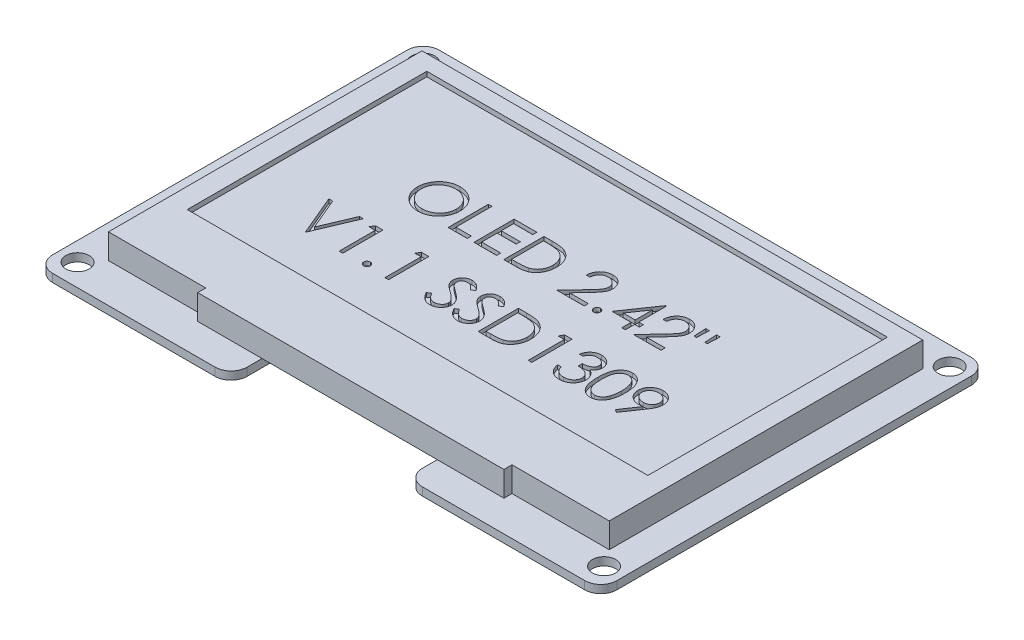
from build123d import *

# Parameters (mm, degrees)
BOSS_EXTRUDE1_DEPTH = 1
SKETCH2_W           = 21.8
SKETCH2_H           = 1
SKETCH2_W_2         = 8
SKETCH2_W_3         = 8.3
BOSS_EXTRUDE2_DEPTH = 3.1
CUT_EXTRUDE1_REACH  = 44.662
SKETCH3_R           = 1.45
SKETCH4_W           = 17.6
SKETCH4_H           = 4.6
BOSS_EXTRUDE3_DEPTH = 2
BOSS_EXTRUDE4_DEPTH = 2
SKETCH6_W           = 57.3
SKETCH6_H           = 29.8
CUT_EXTRUDE2_DEPTH  = 0.6
CUT_EXTRUDE3_DEPTH  = 0.5
SKETCH8_R           = 0.45
CUT_EXTRUDE4_DEPTH  = 43.661721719


with BuildPart() as part:
    # Sketch1 → Boss-Extrude1 (new body)
    with BuildSketch(Plane(origin=(0, 0, 0), x_dir=(1, 0, 0), z_dir=(0, 1, 0))):
        with BuildLine():
            Line((-33.1, -24.05), (-12.9, -24.05))
            ThreePointArc((-12.9, -24.05), (-11.485786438, -23.464213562), (-10.9, -22.05))
            Line((-10.9, -22.05), (-10.9, -18.82))
            ThreePointArc((-10.9, -18.82), (-10.314213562, -17.405786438), (-8.9, -16.82))
            Line((-8.9, -16.82), (8.9, -16.82))
            ThreePointArc((8.9, -16.82), (10.314213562, -17.405786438), (10.9, -18.82))
            Line((10.9, -18.82), (10.9, -22.05))
            ThreePointArc((10.9, -22.05), (11.485786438, -23.464213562), (12.9, -24.05))
            Line((12.9, -24.05), (33.1, -24.05))
            ThreePointArc((33.1, -24.05), (34.514213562, -23.464213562), (35.1, -22.05))
            Line((35.1, -22.05), (35.1, 22.05))
            ThreePointArc((35.1, 22.05), (34.514213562, 23.464213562), (33.1, 24.05))
            Line((33.1, 24.05), (-33.1, 24.05))
            ThreePointArc((-33.1, 24.05), (-34.514213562, 23.464213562), (-35.1, 22.05))
            Line((-35.1, 22.05), (-35.1, -22.05))
            ThreePointArc((-35.1, -22.05), (-34.514213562, -23.464213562), (-33.1, -24.05))
        make_face()
    extrude(amount=BOSS_EXTRUDE1_DEPTH)

    # Sketch2 → Boss-Extrude2 (add)
    with BuildSketch(Plane(origin=(0, 1, 0), x_dir=(1, 0, 0), z_dir=(0, 1, 0))):
        with BuildLine():
            Line((31.3, 19.8), (-31, 19.8))
            Line((-31, 19.8), (-31, -19.2))
            Line((-31, -19.2), (-18.9, -19.2))
            Line((-18.9, -19.2), (-10.9, -19.2))
            Line((-10.9, -19.2), (-10.9, -18.82))
            ThreePointArc((-10.9, -18.82), (-10.314213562, -17.405786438), (-8.9, -16.82))
            Line((-8.9, -16.82), (8.9, -16.82))
            ThreePointArc((8.9, -16.82), (10.314213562, -17.405786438), (10.9, -18.82))
            Line((10.9, -18.82), (10.9, -19.2))
            Line((10.9, -19.2), (19.2, -19.2))
            Line((19.2, -19.2), (31.3, -19.2))
            Line((31.3, -19.2), (31.3, 19.8))
        make_face()
        with BuildLine():
            Line((-10.9, -18.82), (-10.9, -19.2))
            Line((-10.9, -19.2), (10.9, -19.2))
            Line((10.9, -19.2), (10.9, -18.82))
            ThreePointArc((10.9, -18.82), (10.314213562, -17.405786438), (8.9, -16.82))
            Line((8.9, -16.82), (-8.9, -16.82))
            ThreePointArc((-8.9, -16.82), (-10.314213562, -17.405786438), (-10.9, -18.82))
        make_face()
        with Locations((0, -19.7)):
            Rectangle(SKETCH2_W, SKETCH2_H)
        with Locations((-14.9, -19.7)):
            Rectangle(SKETCH2_W_2, SKETCH2_H)
        with Locations((15.05, -19.7)):
            Rectangle(SKETCH2_W_3, SKETCH2_H)
    extrude(amount=BOSS_EXTRUDE2_DEPTH)

    # Sketch3 → Cut-Extrude1 (cut, up to next)
    with BuildSketch(Plane(origin=(0, 1, 0), x_dir=(1, 0, 0), z_dir=(0, 1, 0)), mode=Mode.PRIVATE) as cut_extrude1_sk1:
        with Locations(Location((-32.75, 21.7, 0), (0, 0, 270))):
            Circle(SKETCH3_R)
    cut_extrude1_tool1 = extrude(cut_extrude1_sk1.sketch, amount=-CUT_EXTRUDE1_REACH, mode=Mode.PRIVATE) & part.part
    # Sketch3 → Cut-Extrude1 (cut, up to next)
    with BuildSketch(Plane(origin=(0, 1, 0), x_dir=(1, 0, 0), z_dir=(0, 1, 0)), mode=Mode.PRIVATE) as cut_extrude1_sk2:
        with Locations(Location((32.75, 21.7, 0), (0, 0, 270))):
            Circle(SKETCH3_R)
    cut_extrude1_tool2 = extrude(cut_extrude1_sk2.sketch, amount=-CUT_EXTRUDE1_REACH, mode=Mode.PRIVATE) & part.part
    # Sketch3 → Cut-Extrude1 (cut, up to next)
    with BuildSketch(Plane(origin=(0, 1, 0), x_dir=(1, 0, 0), z_dir=(0, 1, 0)), mode=Mode.PRIVATE) as cut_extrude1_sk3:
        with Locations(Location((32.75, -21.3, 0), (0, 0, 270))):
            Circle(SKETCH3_R)
    cut_extrude1_tool3 = extrude(cut_extrude1_sk3.sketch, amount=-CUT_EXTRUDE1_REACH, mode=Mode.PRIVATE) & part.part
    # Sketch3 → Cut-Extrude1 (cut, up to next)
    with BuildSketch(Plane(origin=(0, 1, 0), x_dir=(1, 0, 0), z_dir=(0, 1, 0)), mode=Mode.PRIVATE) as cut_extrude1_sk4:
        with Locations(Location((-32.75, -21.3, 0), (0, 0, 270))):
            Circle(SKETCH3_R)
    cut_extrude1_tool4 = extrude(cut_extrude1_sk4.sketch, amount=-CUT_EXTRUDE1_REACH, mode=Mode.PRIVATE) & part.part
    add(cut_extrude1_tool1.solids().sort_by_distance((-32.75, 1, -21.7))[0], mode=Mode.SUBTRACT)
    add(cut_extrude1_tool2.solids().sort_by_distance((32.75, 1, -21.7))[0], mode=Mode.SUBTRACT)
    add(cut_extrude1_tool3.solids().sort_by_distance((32.75, 1, 21.3))[0], mode=Mode.SUBTRACT)
    add(cut_extrude1_tool4.solids().sort_by_distance((-32.75, 1, 21.3))[0], mode=Mode.SUBTRACT)

    # Sketch4 → Boss-Extrude3 (add)
    with BuildSketch(Plane.XZ):
        with Locations((0, -5.15)):
            Rectangle(SKETCH4_W, SKETCH4_H)
    extrude(amount=BOSS_EXTRUDE3_DEPTH)

    # Sketch5 → Boss-Extrude4 (add)
    with BuildSketch(Plane.XZ):
        with BuildLine():
            Line((24.1, -19.75), (17.1, -19.75))
            ThreePointArc((17.1, -19.75), (15.1, -17.75), (17.1, -15.75))
            Line((17.1, -15.75), (24.1, -15.75))
            ThreePointArc((24.1, -15.75), (26.1, -17.75), (24.1, -19.75))
        make_face()
        with BuildLine():
            Line((-17.1, -19.75), (-24.1, -19.75))
            ThreePointArc((-24.1, -19.75), (-26.1, -17.75), (-24.1, -15.75))
            Line((-24.1, -15.75), (-17.1, -15.75))
            ThreePointArc((-17.1, -15.75), (-15.1, -17.75), (-17.1, -19.75))
        make_face()
        with BuildLine():
            Line((-17.1, 15.85), (-24.1, 15.85))
            ThreePointArc((-24.1, 15.85), (-26.1, 17.85), (-24.1, 19.85))
            Line((-24.1, 19.85), (-17.1, 19.85))
            ThreePointArc((-17.1, 19.85), (-15.1, 17.85), (-17.1, 15.85))
        make_face()
        with BuildLine():
            Line((24.1, 15.85), (17.1, 15.85))
            ThreePointArc((17.1, 15.85), (15.1, 17.85), (17.1, 19.85))
            Line((17.1, 19.85), (24.1, 19.85))
            ThreePointArc((24.1, 19.85), (26.1, 17.85), (24.1, 15.85))
        make_face()
    extrude(amount=BOSS_EXTRUDE4_DEPTH)

    # Sketch6 → Cut-Extrude2 (cut)
    with BuildSketch(Plane(origin=(0, 4.1, 0), x_dir=(1, 0, 0), z_dir=(0, 1, 0))):
        with Locations((0.15, 3)):
            Rectangle(SKETCH6_W, SKETCH6_H)
    extrude(amount=-CUT_EXTRUDE2_DEPTH, mode=Mode.SUBTRACT)

    # Sketch7 → Cut-Extrude3 (cut)
    # profile 1 of 21: a face of its own
    with BuildSketch(Plane(origin=(0, 3.5, 0), x_dir=(1, 0, 0), z_dir=(0, 1, 0))):
        with BuildLine():
            add(Edge.make_bspline(
                [(-14.625641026, 8.128205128), (-14.533058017, 8.125860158), (-14.35121735, 8.121254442), (-14.083967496, 8.08599858), (-13.828831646, 8.025005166), (-13.583731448, 7.943772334), (-13.351598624, 7.835408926), (-13.13068592, 7.704430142), (-12.921518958, 7.549463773), (-12.726916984, 7.371707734), (-12.548835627, 7.1783028), (-12.391941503, 6.971905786), (-12.260452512, 6.75376464), (-12.152472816, 6.524534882), (-12.067760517, 6.284734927), (-12.00930474, 6.033086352), (-11.971964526, 5.771219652), (-11.967599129, 5.592609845), (-11.965384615, 5.502003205)],
                knots=[0, 0, 0, 0, 1.065120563, 2.091984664, 3.0946048, 4.079830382, 5.057816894, 6.036188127, 7.030412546, 8.04752943, 9.064399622, 10.05169764, 11.02544977, 11.989514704, 12.962713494, 13.945757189, 14.957906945, 16, 16, 16, 16], degree=3))
            add(Edge.make_bspline(
                [(-11.965384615, 5.502003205), (-11.967598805, 5.412063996), (-11.971963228, 5.234783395), (-12.009347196, 4.974578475), (-12.067977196, 4.724448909), (-12.151686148, 4.484812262), (-12.259151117, 4.255415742), (-12.391515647, 4.036862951), (-12.547431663, 3.829082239), (-12.724870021, 3.63434986), (-12.918300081, 3.455782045), (-13.125771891, 3.300183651), (-13.342619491, 3.166292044), (-13.57163336, 3.059458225), (-13.80977627, 2.974069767), (-14.059179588, 2.915851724), (-14.318674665, 2.878298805), (-14.495633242, 2.873986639), (-14.585576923, 2.871794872)],
                knots=[0, 0, 0, 0, 1.043624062, 2.057103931, 3.04512605, 4.022047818, 4.998200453, 5.980619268, 6.982898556, 8.009068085, 9.034988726, 10.034168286, 11.015286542, 11.987931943, 12.962482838, 13.94673481, 14.956375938, 16, 16, 16, 16], degree=3))
            add(Edge.make_bspline(
                [(-14.585576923, 2.871794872), (-14.676183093, 2.874008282), (-14.854791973, 2.878371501), (-15.116987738, 2.915773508), (-15.368813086, 2.974261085), (-15.609547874, 3.057845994), (-15.839326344, 3.165870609), (-16.058597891, 3.297591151), (-16.266482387, 3.453887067), (-16.461256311, 3.631267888), (-16.639469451, 3.824370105), (-16.794839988, 4.031276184), (-16.92659015, 4.247926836), (-17.034252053, 4.474923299), (-17.119486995, 4.711168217), (-17.177636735, 4.958237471), (-17.215259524, 5.214722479), (-17.219595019, 5.389355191), (-17.221794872, 5.477964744)],
                knots=[0, 0, 0, 0, 1.053102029, 2.075944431, 3.073151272, 4.055350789, 5.033113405, 6.020478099, 7.024410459, 8.052272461, 9.079885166, 10.07527673, 11.055994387, 12.023226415, 12.992069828, 13.970394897, 14.97016774, 16, 16, 16, 16], degree=3))
            add(Edge.make_bspline(
                [(-17.221794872, 5.477964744), (-17.221031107, 5.537439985), (-17.219513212, 5.655640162), (-17.201239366, 5.831163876), (-17.17472265, 6.003864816), (-17.136719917, 6.173251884), (-17.087017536, 6.338910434), (-17.028371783, 6.501982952), (-16.956743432, 6.660816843), (-16.875771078, 6.816164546), (-16.785397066, 6.965604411), (-16.685574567, 7.106860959), (-16.579809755, 7.241119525), (-16.46386205, 7.364900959), (-16.341552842, 7.481806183), (-16.210898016, 7.590038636), (-16.07269481, 7.69057428), (-15.926348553, 7.781174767), (-15.775465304, 7.863116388), (-15.61992705, 7.933433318), (-15.461846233, 7.993784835), (-15.30048245, 8.042700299), (-15.136264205, 8.081317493), (-14.968833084, 8.107613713), (-14.798322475, 8.125934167), (-14.683449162, 8.127444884), (-14.625641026, 8.128205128)],
                knots=[0, 0, 0, 0, 1.037015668, 2.060948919, 3.074880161, 4.083647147, 5.086022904, 6.090072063, 7.104153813, 8.122640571, 9.144368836, 10.147691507, 11.138137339, 12.123020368, 13.103399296, 14.087645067, 15.080126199, 16.082011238, 17.087798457, 18.072939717, 19.057185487, 20.037253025, 21.01195951, 21.997135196, 22.992090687, 24, 24, 24, 24], degree=3))
        make_face()
        with BuildLine():
            add(Edge.make_bspline(
                [(-14.603605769, 7.615384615), (-14.651055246, 7.614806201), (-14.745500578, 7.613654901), (-14.885907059, 7.598489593), (-15.024466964, 7.576875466), (-15.16120891, 7.546044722), (-15.295560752, 7.504038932), (-15.428774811, 7.455694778), (-15.559636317, 7.396807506), (-15.687713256, 7.330275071), (-15.811877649, 7.256633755), (-15.929038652, 7.175245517), (-16.039499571, 7.088019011), (-16.142989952, 6.994750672), (-16.239205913, 6.894965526), (-16.3300412, 6.790176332), (-16.411854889, 6.677387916), (-16.486834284, 6.559658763), (-16.553931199, 6.437142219), (-16.613595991, 6.31112813), (-16.662401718, 6.180588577), (-16.702205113, 6.046939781), (-16.735204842, 5.91039341), (-16.756110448, 5.769913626), (-16.77144239, 5.626206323), (-16.772527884, 5.529089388), (-16.773076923, 5.479967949)],
                knots=[0, 0, 0, 0, 1.008559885, 2.007477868, 2.99961109, 3.989939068, 4.984837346, 5.991145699, 7.001802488, 8.033829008, 9.059044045, 10.069351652, 11.065060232, 12.050310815, 13.029377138, 14.011219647, 14.996725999, 15.989392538, 16.977580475, 17.965360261, 18.951710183, 19.937753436, 20.929683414, 21.935841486, 22.955955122, 24, 24, 24, 24], degree=3))
            add(Edge.make_bspline(
                [(-16.773076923, 5.479967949), (-16.771255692, 5.407736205), (-16.767672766, 5.265634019), (-16.736304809, 5.057393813), (-16.687987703, 4.85726769), (-16.616762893, 4.666350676), (-16.527690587, 4.483001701), (-16.417652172, 4.308847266), (-16.28728205, 4.143840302), (-16.139191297, 3.989132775), (-15.977301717, 3.847924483), (-15.805397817, 3.723976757), (-15.625321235, 3.619104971), (-15.436602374, 3.533669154), (-15.240248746, 3.465969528), (-15.034995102, 3.419571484), (-14.822208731, 3.389035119), (-14.677164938, 3.386102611), (-14.603605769, 3.384615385)],
                knots=[0, 0, 0, 0, 1.032063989, 2.030389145, 3.003944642, 3.970395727, 4.937377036, 5.913328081, 6.909231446, 7.93887556, 8.970685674, 9.976071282, 10.964166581, 11.944589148, 12.933237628, 13.927779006, 14.949070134, 16, 16, 16, 16], degree=3))
            add(Edge.make_bspline(
                [(-14.603605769, 3.384615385), (-14.554163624, 3.385294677), (-14.456105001, 3.386641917), (-14.310254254, 3.400211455), (-14.167031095, 3.421971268), (-14.026636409, 3.453300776), (-13.889229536, 3.492511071), (-13.75423696, 3.53909354), (-13.623096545, 3.597209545), (-13.49415392, 3.661420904), (-13.370730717, 3.734621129), (-13.252908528, 3.813247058), (-13.143657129, 3.900345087), (-13.040244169, 3.992227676), (-12.943633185, 4.090747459), (-12.854477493, 4.195776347), (-12.773077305, 4.307977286), (-12.698126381, 4.425527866), (-12.631264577, 4.548379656), (-12.573008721, 4.674850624), (-12.523585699, 4.804629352), (-12.483687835, 4.937903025), (-12.452422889, 5.074418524), (-12.430880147, 5.214358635), (-12.415810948, 5.35744341), (-12.414675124, 5.454220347), (-12.414102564, 5.503004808)],
                knots=[0, 0, 0, 0, 1.047197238, 2.076906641, 3.100256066, 4.114471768, 5.12198147, 6.126382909, 7.136867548, 8.15857795, 9.17633901, 10.174870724, 11.156907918, 12.133735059, 13.104061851, 14.077631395, 15.04955518, 16.038496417, 17.029181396, 18.010275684, 18.986308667, 19.968651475, 20.955262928, 21.950658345, 22.966943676, 24, 24, 24, 24], degree=3))
            add(Edge.make_bspline(
                [(-12.414102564, 5.503004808), (-12.414675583, 5.551455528), (-12.41581227, 5.647566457), (-12.430872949, 5.78965334), (-12.452445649, 5.9285865), (-12.483535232, 6.063820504), (-12.52360688, 6.195389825), (-12.573017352, 6.323170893), (-12.631282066, 6.447639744), (-12.698150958, 6.568488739), (-12.77331642, 6.684452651), (-12.855451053, 6.79531324), (-12.945972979, 6.898988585), (-13.042295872, 6.998038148), (-13.146825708, 7.090349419), (-13.259088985, 7.175953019), (-13.37772281, 7.25691484), (-13.503333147, 7.329951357), (-13.632967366, 7.397400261), (-13.765987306, 7.455187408), (-13.90088602, 7.504290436), (-14.037320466, 7.546171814), (-14.176439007, 7.576754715), (-14.317301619, 7.598509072), (-14.459713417, 7.613649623), (-14.555489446, 7.614804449), (-14.603605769, 7.615384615)],
                knots=[0, 0, 0, 0, 1.02996197, 2.043119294, 3.035359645, 4.018872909, 4.991431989, 5.957985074, 6.929999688, 7.912076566, 8.892894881, 9.867085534, 10.843653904, 11.817741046, 12.803660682, 13.806313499, 14.818574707, 15.856120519, 16.894564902, 17.924820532, 18.937903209, 19.946497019, 20.957711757, 21.963978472, 22.977135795, 24, 24, 24, 24], degree=3))
        make_face(mode=Mode.SUBTRACT)
    # profile 2 of 21: a face of its own
    with BuildSketch(Plane(origin=(0, 3.5, 0), x_dir=(1, 0, 0), z_dir=(0, 1, 0))):
        Polygon((-10.93974359, 8), (-10.491025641, 8), (-10.491025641, 3.512820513), (-8.567948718, 3.512820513), (-8.567948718, 3), (-10.93974359, 3), align=None)
    # profile 3 of 21: a face of its own
    with BuildSketch(Plane(origin=(0, 3.5, 0), x_dir=(1, 0, 0), z_dir=(0, 1, 0))):
        Polygon((-7.734615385, 8), (-4.914102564, 8), (-4.914102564, 7.487179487), (-7.285897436, 7.487179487), (-7.285897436, 5.948717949), (-4.914102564, 5.948717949), (-4.914102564, 5.435897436), (-7.285897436, 5.435897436), (-7.285897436, 3.512820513), (-4.914102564, 3.512820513), (-4.914102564, 3), (-7.734615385, 3), align=None)
    # profile 4 of 21: a face of its own
    with BuildSketch(Plane(origin=(0, 3.5, 0), x_dir=(1, 0, 0), z_dir=(0, 1, 0))):
        with BuildLine():
            Line((-4.016666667, 3), (-4.016666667, 8))
            Line((-4.016666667, 8), (-3.007051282, 8))
            add(Edge.make_bspline(
                [(-3.007051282, 8), (-2.919238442, 7.999367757), (-2.749584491, 7.998146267), (-2.504423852, 7.990401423), (-2.277589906, 7.976700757), (-2.069828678, 7.956744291), (-1.880569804, 7.932239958), (-1.710343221, 7.901525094), (-1.558268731, 7.865256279), (-1.464740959, 7.834334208), (-1.420512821, 7.819711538)],
                knots=[0, 0, 0, 0, 1.314313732, 2.53924729, 3.670748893, 4.714932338, 5.66265055, 6.526160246, 7.303039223, 8, 8, 8, 8], degree=3))
            add(Edge.make_bspline(
                [(-1.420512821, 7.819711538), (-1.362663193, 7.797667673), (-1.248275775, 7.754079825), (-1.085408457, 7.671856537), (-0.93208651, 7.578694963), (-0.787487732, 7.474472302), (-0.654915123, 7.356237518), (-0.529189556, 7.22901311), (-0.415454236, 7.088172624), (-0.311299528, 6.936636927), (-0.217391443, 6.776191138), (-0.135764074, 6.607140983), (-0.067972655, 6.430344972), (-0.011696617, 6.24629476), (0.032655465, 6.054585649), (0.062915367, 5.854994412), (0.082873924, 5.648309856), (0.084879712, 5.508060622), (0.085897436, 5.436899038)],
                knots=[0, 0, 0, 0, 0.984719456, 1.947108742, 2.898477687, 3.838006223, 4.779231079, 5.722358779, 6.681677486, 7.655904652, 8.64651281, 9.637519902, 10.640069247, 11.656948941, 12.698408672, 13.768548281, 14.867775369, 16, 16, 16, 16], degree=3))
            add(Edge.make_bspline(
                [(0.085897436, 5.436899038), (0.084998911, 5.375097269), (0.083228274, 5.253310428), (0.067329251, 5.073823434), (0.044220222, 4.899661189), (0.008442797, 4.731653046), (-0.034989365, 4.568327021), (-0.090652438, 4.411423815), (-0.154417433, 4.259504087), (-0.228774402, 4.114621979), (-0.310404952, 3.977360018), (-0.398007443, 3.847966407), (-0.491488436, 3.728287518), (-0.59173934, 3.61796093), (-0.697464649, 3.51715296), (-0.80935655, 3.42502151), (-0.927703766, 3.343369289), (-1.051976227, 3.268987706), (-1.185799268, 3.204101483), (-1.331707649, 3.149201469), (-1.490323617, 3.103706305), (-1.661257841, 3.065747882), (-1.844805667, 3.03563745), (-2.041147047, 3.015456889), (-2.249980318, 3.001809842), (-2.393379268, 3.000614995), (-2.4671875, 3)],
                knots=[0, 0, 0, 0, 1.105936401, 2.179363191, 3.223086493, 4.248585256, 5.251745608, 6.245858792, 7.225916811, 8.198733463, 9.158002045, 10.082870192, 10.993790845, 11.873723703, 12.748670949, 13.606408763, 14.465103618, 15.319838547, 16.196477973, 17.123216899, 18.106603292, 19.147568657, 20.255746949, 21.433717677, 22.679120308, 24, 24, 24, 24], degree=3))
            Line((-2.4671875, 3), (-4.016666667, 3))
        make_face()
        with BuildLine():
            Line((-3.567948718, 3.512820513), (-2.994030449, 3.512820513))
            add(Edge.make_bspline(
                [(-2.994030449, 3.512820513), (-2.911561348, 3.513174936), (-2.752943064, 3.513856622), (-2.524860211, 3.519838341), (-2.316461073, 3.529612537), (-2.12771606, 3.54329122), (-1.958731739, 3.561389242), (-1.809154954, 3.581567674), (-1.679476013, 3.60670689), (-1.601005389, 3.629493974), (-1.56474359, 3.640024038)],
                knots=[0, 0, 0, 0, 1.375205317, 2.645023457, 3.804390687, 4.853969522, 5.800190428, 6.637939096, 7.370582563, 8, 8, 8, 8], degree=3))
            add(Edge.make_bspline(
                [(-1.56474359, 3.640024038), (-1.519103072, 3.656097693), (-1.428912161, 3.687861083), (-1.299082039, 3.745800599), (-1.178000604, 3.814432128), (-1.063557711, 3.89072109), (-0.957376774, 3.977358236), (-0.858199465, 4.072459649), (-0.766225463, 4.176509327), (-0.682405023, 4.28937813), (-0.60739316, 4.410363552), (-0.542434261, 4.538276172), (-0.485503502, 4.671714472), (-0.440819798, 4.812727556), (-0.405797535, 4.960054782), (-0.380990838, 5.113706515), (-0.365541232, 5.273654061), (-0.363739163, 5.38244281), (-0.362820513, 5.437900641)],
                knots=[0, 0, 0, 0, 0.998632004, 1.973411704, 2.929992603, 3.868527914, 4.809262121, 5.754881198, 6.702106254, 7.672490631, 8.653608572, 9.636854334, 10.631411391, 11.644891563, 12.686317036, 13.754757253, 14.855430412, 16, 16, 16, 16], degree=3))
            add(Edge.make_bspline(
                [(-0.362820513, 5.437900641), (-0.36355378, 5.496377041), (-0.364994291, 5.611254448), (-0.383100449, 5.779812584), (-0.409559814, 5.941927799), (-0.447822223, 6.097610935), (-0.496580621, 6.247165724), (-0.557430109, 6.389765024), (-0.626953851, 6.526914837), (-0.709672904, 6.655449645), (-0.800266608, 6.77701123), (-0.900806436, 6.888375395), (-1.009695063, 6.989795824), (-1.125744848, 7.082851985), (-1.252226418, 7.163800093), (-1.386160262, 7.236209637), (-1.529511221, 7.297660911), (-1.629243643, 7.330345), (-1.679927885, 7.346955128)],
                knots=[0, 0, 0, 0, 1.122418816, 2.205001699, 3.251619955, 4.274784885, 5.280384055, 6.268708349, 7.249350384, 8.229342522, 9.199999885, 10.157847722, 11.105861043, 12.055065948, 13.010012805, 13.98527497, 14.976112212, 16, 16, 16, 16], degree=3))
            add(Edge.make_bspline(
                [(-1.679927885, 7.346955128), (-1.721858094, 7.358550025), (-1.811013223, 7.383203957), (-1.956498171, 7.410097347), (-2.120234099, 7.43381806), (-2.302947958, 7.453900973), (-2.504431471, 7.468311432), (-2.724839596, 7.479127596), (-2.964267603, 7.486422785), (-3.130242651, 7.486920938), (-3.216386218, 7.487179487)],
                knots=[0, 0, 0, 0, 0.674548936, 1.434276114, 2.292660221, 3.240891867, 4.284742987, 5.42552168, 6.663806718, 8, 8, 8, 8], degree=3))
            Line((-3.216386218, 7.487179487), (-3.567948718, 7.487179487))
            Line((-3.567948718, 7.487179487), (-3.567948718, 3.512820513))
        make_face(mode=Mode.SUBTRACT)
    # profile 5 of 21: a face of its own
    with BuildSketch(Plane(origin=(0, 3.5, 0), x_dir=(1, 0, 0), z_dir=(0, 1, 0))):
        with BuildLine():
            Line((3.226923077, 6.461538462), (2.778205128, 6.461538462))
            add(Edge.make_bspline(
                [(2.778205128, 6.461538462), (2.781129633, 6.521068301), (2.786873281, 6.637983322), (2.813770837, 6.808446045), (2.852257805, 6.971381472), (2.906674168, 7.125481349), (2.974254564, 7.272108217), (3.055297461, 7.410679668), (3.151288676, 7.54066708), (3.260155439, 7.660865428), (3.378396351, 7.771133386), (3.505976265, 7.866355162), (3.64004059, 7.946808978), (3.780182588, 8.014067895), (3.927983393, 8.064553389), (4.082101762, 8.102012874), (4.243214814, 8.124550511), (4.352986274, 8.126973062), (4.408814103, 8.128205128)],
                knots=[0, 0, 0, 0, 1.10065271, 2.161652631, 3.183658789, 4.190468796, 5.17591951, 6.163126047, 7.15150782, 8.156236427, 9.156009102, 10.134482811, 11.092018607, 12.041330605, 13.001268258, 13.972401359, 14.968799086, 16, 16, 16, 16], degree=3))
            add(Edge.make_bspline(
                [(4.408814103, 8.128205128), (4.463639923, 8.126921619), (4.571370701, 8.124399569), (4.72860215, 8.102740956), (4.878283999, 8.068818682), (5.020123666, 8.02122523), (5.152989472, 7.957247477), (5.277879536, 7.88039385), (5.396280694, 7.791508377), (5.502861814, 7.686860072), (5.600730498, 7.57514238), (5.685162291, 7.455873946), (5.757466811, 7.332689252), (5.817734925, 7.204648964), (5.862100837, 7.070547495), (5.895783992, 6.932337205), (5.914823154, 6.788587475), (5.917745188, 6.691292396), (5.919230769, 6.641826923)],
                knots=[0, 0, 0, 0, 1.111607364, 2.184268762, 3.212621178, 4.221274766, 5.211760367, 6.196651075, 7.1921475, 8.207485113, 9.220403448, 10.201281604, 11.166441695, 12.114753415, 13.065576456, 14.026450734, 14.996634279, 16, 16, 16, 16], degree=3))
            add(Edge.make_bspline(
                [(5.919230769, 6.641826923), (5.916811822, 6.572187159), (5.912016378, 6.434129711), (5.87099584, 6.231251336), (5.806929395, 6.034689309), (5.729790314, 5.876493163), (5.651972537, 5.749016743), (5.581847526, 5.64406145), (5.499754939, 5.531053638), (5.404499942, 5.410371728), (5.298052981, 5.281070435), (5.179449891, 5.14322787), (5.047844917, 4.998268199), (4.95547563, 4.899260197), (4.907612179, 4.847956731)],
                knots=[0, 0, 0, 0, 1.184426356, 2.348067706, 3.509069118, 4.696110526, 5.333549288, 6.050745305, 6.844228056, 7.710549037, 8.667450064, 9.695053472, 10.805634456, 12, 12, 12, 12], degree=3))
            Line((4.907612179, 4.847956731), (3.656610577, 3.512820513))
            Line((3.656610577, 3.512820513), (5.983333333, 3.512820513))
            Line((5.983333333, 3.512820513), (5.983333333, 3))
            Line((5.983333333, 3), (2.585897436, 3))
            Line((2.585897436, 3), (4.525, 5.069310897))
            add(Edge.make_bspline(
                [(4.525, 5.069310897), (4.572211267, 5.118594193), (4.662894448, 5.213257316), (4.791155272, 5.351461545), (4.906353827, 5.479675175), (5.009235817, 5.597655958), (5.097569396, 5.707129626), (5.175958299, 5.804550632), (5.238766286, 5.894199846), (5.306931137, 5.998115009), (5.37295111, 6.124989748), (5.429683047, 6.280037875), (5.464275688, 6.439648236), (5.468425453, 6.547508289), (5.470512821, 6.601762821)],
                knots=[0, 0, 0, 0, 1.329631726, 2.553950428, 3.673215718, 4.687767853, 5.603093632, 6.413772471, 7.123043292, 7.734684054, 8.834405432, 9.900288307, 10.943827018, 12, 12, 12, 12], degree=3))
            add(Edge.make_bspline(
                [(5.470512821, 6.601762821), (5.469604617, 6.635879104), (5.467814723, 6.703115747), (5.452018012, 6.801695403), (5.428145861, 6.896787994), (5.393938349, 6.988686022), (5.348785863, 7.076465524), (5.293823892, 7.160233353), (5.230409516, 7.241217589), (5.15705056, 7.317150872), (5.076462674, 7.386695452), (4.991328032, 7.448301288), (4.901256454, 7.499785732), (4.806627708, 7.541990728), (4.707705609, 7.575098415), (4.60429883, 7.598039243), (4.496693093, 7.612442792), (4.42321667, 7.614391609), (4.385777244, 7.615384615)],
                knots=[0, 0, 0, 0, 0.991446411, 1.95395049, 2.89581595, 3.838931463, 4.798493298, 5.75982156, 6.748411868, 7.785213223, 8.824556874, 9.840280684, 10.836137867, 11.835679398, 12.848801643, 13.863922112, 14.911575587, 16, 16, 16, 16], degree=3))
            add(Edge.make_bspline(
                [(4.385777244, 7.615384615), (4.346676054, 7.614363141), (4.269887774, 7.612357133), (4.157146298, 7.598324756), (4.049595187, 7.574116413), (3.946963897, 7.541006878), (3.849078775, 7.498923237), (3.756415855, 7.446506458), (3.669183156, 7.383958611), (3.587216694, 7.313043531), (3.511696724, 7.234089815), (3.445344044, 7.146075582), (3.387366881, 7.050607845), (3.336782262, 6.947944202), (3.295702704, 6.837153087), (3.264312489, 6.718627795), (3.239474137, 6.592882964), (3.23117625, 6.506047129), (3.226923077, 6.461538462)],
                knots=[0, 0, 0, 0, 1.031018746, 2.02475058, 2.990194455, 3.934040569, 4.864654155, 5.795059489, 6.735614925, 7.690564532, 8.649604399, 9.611025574, 10.590972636, 11.591080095, 12.624614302, 13.701020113, 14.821632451, 16, 16, 16, 16], degree=3))
        make_face()
    # profile 6 of 21: a face of its own
    with BuildSketch(Plane(origin=(0, 3.5, 0), x_dir=(1, 0, 0), z_dir=(0, 1, 0))):
        with BuildLine():
            add(Edge.make_bspline(
                [(7.233333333, 3.769230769), (7.261176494, 3.767576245), (7.315759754, 3.764332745), (7.394672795, 3.742080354), (7.466093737, 3.702567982), (7.52971123, 3.64990687), (7.582149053, 3.586055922), (7.623069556, 3.515204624), (7.645128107, 3.43563092), (7.648347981, 3.380731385), (7.65, 3.352564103)],
                knots=[0, 0, 0, 0, 1.020151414, 1.999887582, 2.974338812, 3.990962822, 5.007586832, 5.987933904, 6.967670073, 8, 8, 8, 8], degree=3))
            add(Edge.make_bspline(
                [(7.65, 3.352564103), (7.648291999, 3.325073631), (7.644923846, 3.270862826), (7.62312012, 3.191889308), (7.581837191, 3.12099373), (7.530072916, 3.05627639), (7.46607801, 3.003503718), (7.394503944, 2.964327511), (7.315945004, 2.940481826), (7.261207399, 2.937444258), (7.233333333, 2.935897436)],
                knots=[0, 0, 0, 0, 1.009421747, 1.99056486, 2.972319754, 3.999869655, 5.017953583, 5.993804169, 6.978383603, 8, 8, 8, 8], degree=3))
            add(Edge.make_bspline(
                [(7.233333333, 2.935897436), (7.205439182, 2.937388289), (7.150982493, 2.940298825), (7.072716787, 2.964817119), (7.000706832, 3.003136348), (6.936724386, 3.056374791), (6.88452657, 3.12066071), (6.845061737, 3.192377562), (6.821361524, 3.270636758), (6.818244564, 3.325029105), (6.816666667, 3.352564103)],
                knots=[0, 0, 0, 0, 1.022052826, 1.995314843, 2.982371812, 4.00089066, 5.028879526, 6.005146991, 6.990147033, 8, 8, 8, 8], degree=3))
            add(Edge.make_bspline(
                [(6.816666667, 3.352564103), (6.818183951, 3.380777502), (6.821146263, 3.435860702), (6.845111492, 3.51471657), (6.884220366, 3.586385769), (6.937085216, 3.649809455), (7.000691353, 3.702934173), (7.072543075, 3.741598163), (7.15117099, 3.764513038), (7.205470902, 3.767630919), (7.233333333, 3.769230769)],
                knots=[0, 0, 0, 0, 1.032775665, 2.016367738, 2.991239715, 4.008302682, 5.025365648, 6.011011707, 6.979408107, 8, 8, 8, 8], degree=3))
        make_face()
    # profile 7 of 21: a face of its own
    with BuildSketch(Plane(origin=(0, 3.5, 0), x_dir=(1, 0, 0), z_dir=(0, 1, 0))):
        Polygon((11.020392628, 8.128205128), (11.111538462, 8.128205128), (11.111538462, 4.666666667), (11.688461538, 4.666666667), (11.688461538, 4.153846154), (11.111538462, 4.153846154), (11.111538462, 3), (10.662820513, 3), (10.662820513, 4.153846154), (8.291025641, 4.153846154), align=None)
        Polygon((10.662820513, 4.666666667), (10.662820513, 6.838141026), (9.172435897, 4.666666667), align=None, mode=Mode.SUBTRACT)
    # profile 8 of 21: a face of its own
    with BuildSketch(Plane(origin=(0, 3.5, 0), x_dir=(1, 0, 0), z_dir=(0, 1, 0))):
        with BuildLine():
            Line((12.778205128, 6.461538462), (12.329487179, 6.461538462))
            add(Edge.make_bspline(
                [(12.329487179, 6.461538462), (12.332411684, 6.521068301), (12.338155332, 6.637983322), (12.365052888, 6.808446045), (12.403539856, 6.971381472), (12.457956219, 7.125481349), (12.525536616, 7.272108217), (12.606579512, 7.410679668), (12.702570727, 7.54066708), (12.81143749, 7.660865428), (12.929678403, 7.771133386), (13.057258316, 7.866355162), (13.191322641, 7.946808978), (13.331464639, 8.014067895), (13.479265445, 8.064553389), (13.633383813, 8.102012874), (13.794496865, 8.124550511), (13.904268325, 8.126973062), (13.960096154, 8.128205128)],
                knots=[0, 0, 0, 0, 1.10065271, 2.161652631, 3.183658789, 4.190468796, 5.17591951, 6.163126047, 7.15150782, 8.156236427, 9.156009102, 10.134482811, 11.092018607, 12.041330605, 13.001268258, 13.972401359, 14.968799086, 16, 16, 16, 16], degree=3))
            add(Edge.make_bspline(
                [(13.960096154, 8.128205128), (14.014921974, 8.126921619), (14.122652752, 8.124399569), (14.279884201, 8.102740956), (14.429566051, 8.068818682), (14.571405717, 8.02122523), (14.704271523, 7.957247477), (14.829161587, 7.88039385), (14.947562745, 7.791508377), (15.054143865, 7.686860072), (15.152012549, 7.57514238), (15.236444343, 7.455873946), (15.308748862, 7.332689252), (15.369016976, 7.204648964), (15.413382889, 7.070547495), (15.447066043, 6.932337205), (15.466105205, 6.788587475), (15.469027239, 6.691292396), (15.470512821, 6.641826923)],
                knots=[0, 0, 0, 0, 1.111607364, 2.184268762, 3.212621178, 4.221274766, 5.211760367, 6.196651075, 7.1921475, 8.207485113, 9.220403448, 10.201281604, 11.166441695, 12.114753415, 13.065576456, 14.026450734, 14.996634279, 16, 16, 16, 16], degree=3))
            add(Edge.make_bspline(
                [(15.470512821, 6.641826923), (15.468093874, 6.572187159), (15.463298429, 6.434129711), (15.422277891, 6.231251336), (15.358211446, 6.034689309), (15.281072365, 5.876493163), (15.203254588, 5.749016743), (15.133129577, 5.64406145), (15.05103699, 5.531053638), (14.955781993, 5.410371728), (14.849335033, 5.281070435), (14.730731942, 5.14322787), (14.599126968, 4.998268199), (14.506757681, 4.899260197), (14.458894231, 4.847956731)],
                knots=[0, 0, 0, 0, 1.184426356, 2.348067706, 3.509069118, 4.696110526, 5.333549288, 6.050745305, 6.844228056, 7.710549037, 8.667450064, 9.695053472, 10.805634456, 12, 12, 12, 12], degree=3))
            Line((14.458894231, 4.847956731), (13.207892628, 3.512820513))
            Line((13.207892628, 3.512820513), (15.534615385, 3.512820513))
            Line((15.534615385, 3.512820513), (15.534615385, 3))
            Line((15.534615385, 3), (12.137179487, 3))
            Line((12.137179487, 3), (14.076282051, 5.069310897))
            add(Edge.make_bspline(
                [(14.076282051, 5.069310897), (14.123493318, 5.118594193), (14.2141765, 5.213257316), (14.342437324, 5.351461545), (14.457635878, 5.479675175), (14.560517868, 5.597655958), (14.648851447, 5.707129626), (14.72724035, 5.804550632), (14.790048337, 5.894199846), (14.858213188, 5.998115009), (14.924233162, 6.124989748), (14.980965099, 6.280037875), (15.015557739, 6.439648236), (15.019707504, 6.547508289), (15.021794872, 6.601762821)],
                knots=[0, 0, 0, 0, 1.329631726, 2.553950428, 3.673215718, 4.687767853, 5.603093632, 6.413772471, 7.123043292, 7.734684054, 8.834405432, 9.900288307, 10.943827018, 12, 12, 12, 12], degree=3))
            add(Edge.make_bspline(
                [(15.021794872, 6.601762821), (15.020886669, 6.635879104), (15.019096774, 6.703115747), (15.003300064, 6.801695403), (14.979427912, 6.896787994), (14.9452204, 6.988686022), (14.900067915, 7.076465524), (14.845105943, 7.160233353), (14.781691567, 7.241217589), (14.708332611, 7.317150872), (14.627744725, 7.386695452), (14.542610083, 7.448301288), (14.452538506, 7.499785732), (14.35790976, 7.541990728), (14.25898766, 7.575098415), (14.155580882, 7.598039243), (14.047975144, 7.612442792), (13.974498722, 7.614391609), (13.937059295, 7.615384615)],
                knots=[0, 0, 0, 0, 0.991446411, 1.95395049, 2.89581595, 3.838931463, 4.798493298, 5.75982156, 6.748411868, 7.785213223, 8.824556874, 9.840280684, 10.836137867, 11.835679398, 12.848801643, 13.863922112, 14.911575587, 16, 16, 16, 16], degree=3))
            add(Edge.make_bspline(
                [(13.937059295, 7.615384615), (13.897958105, 7.614363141), (13.821169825, 7.612357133), (13.708428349, 7.598324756), (13.600877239, 7.574116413), (13.498245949, 7.541006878), (13.400360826, 7.498923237), (13.307697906, 7.446506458), (13.220465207, 7.383958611), (13.138498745, 7.313043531), (13.062978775, 7.234089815), (12.996626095, 7.146075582), (12.938648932, 7.050607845), (12.888064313, 6.947944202), (12.846984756, 6.837153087), (12.815594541, 6.718627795), (12.790756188, 6.592882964), (12.782458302, 6.506047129), (12.778205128, 6.461538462)],
                knots=[0, 0, 0, 0, 1.031018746, 2.02475058, 2.990194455, 3.934040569, 4.864654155, 5.795059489, 6.735614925, 7.690564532, 8.649604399, 9.611025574, 10.590972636, 11.591080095, 12.624614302, 13.701020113, 14.821632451, 16, 16, 16, 16], degree=3))
        make_face()
    # profile 9 of 21: a face of its own
    with BuildSketch(Plane(origin=(0, 3.5, 0), x_dir=(1, 0, 0), z_dir=(0, 1, 0))):
        Polygon((17.708092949, 6.58974359), (17.396594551, 6.58974359), (17.329487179, 8.128205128), (17.778205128, 8.128205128), align=None)
    # profile 10 of 21: a face of its own
    with BuildSketch(Plane(origin=(0, 3.5, 0), x_dir=(1, 0, 0), z_dir=(0, 1, 0))):
        Polygon((16.36494391, 6.58974359), (16.050440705, 6.58974359), (15.983333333, 8.128205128), (16.432051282, 8.128205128), align=None)
    # profile 11 of 21: a face of its own
    with BuildSketch(Plane(origin=(0, 3.5, 0), x_dir=(1, 0, 0), z_dir=(0, 1, 0))):
        Polygon((-21.452564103, -1.333333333), (-20.971794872, -1.333333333), (-19.305128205, -5.273637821), (-17.638461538, -1.333333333), (-17.157692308, -1.333333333), (-19.273076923, -6.333333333), (-19.337179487, -6.333333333), align=None)
    # profile 12 of 21: a face of its own
    with BuildSketch(Plane(origin=(0, 3.5, 0), x_dir=(1, 0, 0), z_dir=(0, 1, 0))):
        Polygon((-15.646274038, -1.333333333), (-14.721794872, -1.333333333), (-14.721794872, -6.333333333), (-15.170512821, -6.333333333), (-15.170512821, -1.846153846), (-15.93974359, -1.846153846), align=None)
    # profile 13 of 21: a face of its own
    with BuildSketch(Plane(origin=(0, 3.5, 0), x_dir=(1, 0, 0), z_dir=(0, 1, 0))):
        with BuildLine():
            add(Edge.make_bspline(
                [(-12.061538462, -5.564102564), (-12.033695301, -5.565757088), (-11.979112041, -5.569000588), (-11.900199, -5.59125298), (-11.828778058, -5.630765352), (-11.765160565, -5.683426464), (-11.712722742, -5.747277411), (-11.671802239, -5.818128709), (-11.649743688, -5.897702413), (-11.646523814, -5.952601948), (-11.644871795, -5.980769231)],
                knots=[0, 0, 0, 0, 1.020151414, 1.999887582, 2.974338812, 3.990962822, 5.007586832, 5.987933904, 6.967670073, 8, 8, 8, 8], degree=3))
            add(Edge.make_bspline(
                [(-11.644871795, -5.980769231), (-11.646579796, -6.008259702), (-11.649947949, -6.062470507), (-11.671751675, -6.141444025), (-11.713034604, -6.212339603), (-11.764798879, -6.277056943), (-11.828793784, -6.329829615), (-11.900367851, -6.369005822), (-11.978926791, -6.392851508), (-12.033664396, -6.395889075), (-12.061538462, -6.397435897)],
                knots=[0, 0, 0, 0, 1.009421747, 1.99056486, 2.972319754, 3.999869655, 5.017953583, 5.993804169, 6.978383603, 8, 8, 8, 8], degree=3))
            add(Edge.make_bspline(
                [(-12.061538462, -6.397435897), (-12.089432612, -6.395945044), (-12.143889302, -6.393034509), (-12.222155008, -6.368516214), (-12.294164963, -6.330196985), (-12.358147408, -6.276958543), (-12.410345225, -6.212672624), (-12.449810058, -6.140955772), (-12.47351027, -6.062696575), (-12.476627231, -6.008304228), (-12.478205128, -5.980769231)],
                knots=[0, 0, 0, 0, 1.022052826, 1.995314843, 2.982371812, 4.00089066, 5.028879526, 6.005146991, 6.990147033, 8, 8, 8, 8], degree=3))
            add(Edge.make_bspline(
                [(-12.478205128, -5.980769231), (-12.476687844, -5.952555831), (-12.473725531, -5.897472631), (-12.449760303, -5.818616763), (-12.410651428, -5.746947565), (-12.357786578, -5.683523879), (-12.294180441, -5.630399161), (-12.22232872, -5.59173517), (-12.143700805, -5.568820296), (-12.089400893, -5.565702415), (-12.061538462, -5.564102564)],
                knots=[0, 0, 0, 0, 1.032775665, 2.016367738, 2.991239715, 4.008302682, 5.025365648, 6.011011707, 6.979408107, 8, 8, 8, 8], degree=3))
        make_face()
    # profile 14 of 21: a face of its own
    with BuildSketch(Plane(origin=(0, 3.5, 0), x_dir=(1, 0, 0), z_dir=(0, 1, 0))):
        Polygon((-9.941145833, -1.333333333), (-9.016666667, -1.333333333), (-9.016666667, -6.333333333), (-9.465384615, -6.333333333), (-9.465384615, -1.846153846), (-10.234615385, -1.846153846), align=None)
    # profile 15 of 21: a face of its own
    with BuildSketch(Plane(origin=(0, 3.5, 0), x_dir=(1, 0, 0), z_dir=(0, 1, 0))):
        with BuildLine():
            Line((-5.298717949, -5.368790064), (-4.876041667, -5.115384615))
            add(Edge.make_bspline(
                [(-4.876041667, -5.115384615), (-4.836729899, -5.18119088), (-4.76141007, -5.307273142), (-4.635765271, -5.477641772), (-4.505575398, -5.622444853), (-4.36987635, -5.740840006), (-4.229496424, -5.834052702), (-4.083519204, -5.90005589), (-3.932436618, -5.941221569), (-3.829616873, -5.946221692), (-3.778285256, -5.948717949)],
                knots=[0, 0, 0, 0, 1.272034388, 2.437168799, 3.508375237, 4.49857839, 5.41946034, 6.295179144, 7.148887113, 8, 8, 8, 8], degree=3))
            add(Edge.make_bspline(
                [(-3.778285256, -5.948717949), (-3.734446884, -5.947496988), (-3.647537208, -5.94507643), (-3.519591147, -5.921818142), (-3.39533143, -5.886086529), (-3.27731909, -5.83491377), (-3.167182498, -5.773001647), (-3.070601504, -5.698221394), (-2.987107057, -5.614498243), (-2.918808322, -5.52109445), (-2.866408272, -5.420641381), (-2.826133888, -5.317532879), (-2.803783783, -5.21014921), (-2.800416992, -5.137848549), (-2.798717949, -5.101362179)],
                knots=[0, 0, 0, 0, 1.095163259, 2.171163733, 3.241058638, 4.321873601, 5.38011039, 6.391990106, 7.366004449, 8.327778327, 9.272591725, 10.192022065, 11.087607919, 12, 12, 12, 12], degree=3))
            add(Edge.make_bspline(
                [(-2.798717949, -5.101362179), (-2.800824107, -5.059732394), (-2.805105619, -4.975105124), (-2.841293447, -4.850248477), (-2.898220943, -4.726687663), (-2.950739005, -4.650257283), (-2.978004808, -4.610576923)],
                knots=[0, 0, 0, 0, 0.938893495, 1.908633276, 2.914225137, 4, 4, 4, 4], degree=3))
            add(Edge.make_bspline(
                [(-2.978004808, -4.610576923), (-3.000391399, -4.581938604), (-3.047389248, -4.521816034), (-3.128185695, -4.432322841), (-3.22299443, -4.340010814), (-3.328570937, -4.241355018), (-3.448761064, -4.14094388), (-3.57980037, -4.033989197), (-3.725034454, -3.924558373), (-3.826890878, -3.851168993), (-3.879447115, -3.813301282)],
                knots=[0, 0, 0, 0, 0.722233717, 1.516239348, 2.393582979, 3.351407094, 4.387010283, 5.505090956, 6.712668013, 8, 8, 8, 8], degree=3))
            add(Edge.make_bspline(
                [(-3.879447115, -3.813301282), (-3.932052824, -3.775831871), (-4.032630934, -3.704193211), (-4.173286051, -3.597872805), (-4.299063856, -3.500667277), (-4.409405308, -3.411661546), (-4.504261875, -3.330843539), (-4.584381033, -3.25898934), (-4.647721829, -3.194155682), (-4.682944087, -3.152096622), (-4.698758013, -3.133213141)],
                knots=[0, 0, 0, 0, 1.452282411, 2.77665338, 3.964542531, 5.026858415, 5.96415736, 6.766646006, 7.446254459, 8, 8, 8, 8], degree=3))
            add(Edge.make_bspline(
                [(-4.698758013, -3.133213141), (-4.720861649, -3.103783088), (-4.764331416, -3.04590494), (-4.821711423, -2.955440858), (-4.870481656, -2.862836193), (-4.908713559, -2.767842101), (-4.940908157, -2.671792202), (-4.962562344, -2.57343328), (-4.976121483, -2.473206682), (-4.977510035, -2.405758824), (-4.978205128, -2.371995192)],
                knots=[0, 0, 0, 0, 1.068054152, 2.10047183, 3.106115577, 4.101338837, 5.06977816, 6.043150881, 7.020423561, 8, 8, 8, 8], degree=3))
            add(Edge.make_bspline(
                [(-4.978205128, -2.371995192), (-4.976340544, -2.319095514), (-4.97265123, -2.214426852), (-4.941450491, -2.061525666), (-4.8922035, -1.91554507), (-4.823210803, -1.777930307), (-4.734271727, -1.65226462), (-4.631348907, -1.537102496), (-4.508761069, -1.440290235), (-4.374257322, -1.355701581), (-4.227033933, -1.289493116), (-4.072761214, -1.239548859), (-3.911193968, -1.211249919), (-3.801760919, -1.207188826), (-3.746233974, -1.205128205)],
                knots=[0, 0, 0, 0, 1.005424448, 1.989358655, 2.955360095, 3.929531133, 4.905563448, 5.876582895, 6.856512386, 7.866279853, 8.892233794, 9.918561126, 10.94386622, 12, 12, 12, 12], degree=3))
            add(Edge.make_bspline(
                [(-3.746233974, -1.205128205), (-3.687313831, -1.207160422), (-3.570140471, -1.211201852), (-3.397784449, -1.246341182), (-3.231840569, -1.304484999), (-3.09835019, -1.370468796), (-2.993874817, -1.436370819), (-2.914199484, -1.496399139), (-2.833460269, -1.565506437), (-2.751005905, -1.643876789), (-2.668233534, -1.73222929), (-2.583914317, -1.829958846), (-2.497851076, -1.936468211), (-2.442485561, -2.012503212), (-2.414102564, -2.051482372)],
                knots=[0, 0, 0, 0, 1.286793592, 2.559021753, 3.825965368, 5.121522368, 5.803751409, 6.523245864, 7.299691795, 8.125521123, 9.008227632, 9.944561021, 10.946284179, 12, 12, 12, 12], degree=3))
            Line((-2.414102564, -2.051482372), (-2.819751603, -2.358974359))
            add(Edge.make_bspline(
                [(-2.819751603, -2.358974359), (-2.844245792, -2.327419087), (-2.891415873, -2.266651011), (-2.963029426, -2.181549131), (-3.030527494, -2.103811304), (-3.097028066, -2.036289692), (-3.159018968, -1.975286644), (-3.219186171, -1.92305842), (-3.276663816, -1.879093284), (-3.349116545, -1.832173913), (-3.440141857, -1.785664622), (-3.55440548, -1.746308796), (-3.673814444, -1.722658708), (-3.755142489, -1.719531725), (-3.796314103, -1.717948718)],
                knots=[0, 0, 0, 0, 1.181633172, 2.275549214, 3.290209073, 4.226197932, 5.078386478, 5.862611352, 6.581680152, 7.217281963, 8.414376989, 9.595101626, 10.782541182, 12, 12, 12, 12], degree=3))
            add(Edge.make_bspline(
                [(-3.796314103, -1.717948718), (-3.847966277, -1.719679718), (-3.947572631, -1.723017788), (-4.088987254, -1.75947491), (-4.21626429, -1.816877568), (-4.325625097, -1.897327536), (-4.416677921, -1.99264324), (-4.482542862, -2.102327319), (-4.522185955, -2.223445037), (-4.527023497, -2.307933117), (-4.529487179, -2.350961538)],
                knots=[0, 0, 0, 0, 1.14458467, 2.207223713, 3.21896685, 4.227309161, 5.202851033, 6.127160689, 7.046193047, 8, 8, 8, 8], degree=3))
            add(Edge.make_bspline(
                [(-4.529487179, -2.350961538), (-4.52892557, -2.377749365), (-4.527801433, -2.431368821), (-4.51212315, -2.510585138), (-4.491981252, -2.589601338), (-4.460063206, -2.66806217), (-4.415998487, -2.747339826), (-4.35813395, -2.828799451), (-4.28525779, -2.913159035), (-4.229433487, -2.968026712), (-4.199959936, -2.996995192)],
                knots=[0, 0, 0, 0, 0.858281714, 1.717966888, 2.583508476, 3.4729293, 4.427298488, 5.488583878, 6.674047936, 8, 8, 8, 8], degree=3))
            add(Edge.make_bspline(
                [(-4.199959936, -2.996995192), (-4.189015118, -3.006762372), (-4.163012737, -3.029966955), (-4.1154757, -3.067955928), (-4.052700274, -3.114817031), (-3.976325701, -3.172798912), (-3.884943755, -3.240058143), (-3.778544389, -3.315734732), (-3.658313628, -3.402285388), (-3.572996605, -3.46279616), (-3.527884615, -3.494791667)],
                knots=[0, 0, 0, 0, 0.420754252, 0.999615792, 1.744751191, 2.668019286, 3.750313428, 4.999500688, 6.413464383, 8, 8, 8, 8], degree=3))
            add(Edge.make_bspline(
                [(-3.527884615, -3.494791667), (-3.473619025, -3.534279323), (-3.36854123, -3.610741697), (-3.219030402, -3.72562124), (-3.083467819, -3.837975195), (-2.961377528, -3.947086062), (-2.851553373, -4.052126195), (-2.755213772, -4.15435931), (-2.671377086, -4.253052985), (-2.581121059, -4.379585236), (-2.488895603, -4.534986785), (-2.409693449, -4.725384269), (-2.359752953, -4.91652187), (-2.353222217, -5.044988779), (-2.35, -5.108373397)],
                knots=[0, 0, 0, 0, 1.163667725, 2.253281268, 3.268753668, 4.215851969, 5.092017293, 5.902905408, 6.650798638, 7.335211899, 8.59617414, 9.77448103, 10.901945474, 12, 12, 12, 12], degree=3))
            add(Edge.make_bspline(
                [(-2.35, -5.108373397), (-2.350938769, -5.153199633), (-2.352798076, -5.24198161), (-2.37417081, -5.372346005), (-2.405484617, -5.498961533), (-2.452680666, -5.620263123), (-2.510285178, -5.738469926), (-2.583379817, -5.850481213), (-2.668105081, -5.958776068), (-2.765296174, -6.06046677), (-2.871647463, -6.153818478), (-2.984052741, -6.236859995), (-3.102695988, -6.306100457), (-3.226933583, -6.36260166), (-3.356794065, -6.406792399), (-3.492233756, -6.438810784), (-3.633475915, -6.458461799), (-3.729476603, -6.460501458), (-3.778285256, -6.461538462)],
                knots=[0, 0, 0, 0, 0.983748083, 1.948392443, 2.894712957, 3.844097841, 4.80183111, 5.778335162, 6.776009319, 7.81870978, 8.863265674, 9.881300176, 10.883814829, 11.87499822, 12.874611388, 13.892143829, 14.928324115, 16, 16, 16, 16], degree=3))
            add(Edge.make_bspline(
                [(-3.778285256, -6.461538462), (-3.816050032, -6.460808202), (-3.891103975, -6.45935688), (-4.002117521, -6.44652648), (-4.110888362, -6.428373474), (-4.216051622, -6.399553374), (-4.31896221, -6.364586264), (-4.419172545, -6.321531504), (-4.516731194, -6.269935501), (-4.612184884, -6.210942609), (-4.705290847, -6.142288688), (-4.795175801, -6.062326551), (-4.884788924, -5.973261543), (-4.971485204, -5.872675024), (-5.057018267, -5.762192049), (-5.13970171, -5.64077893), (-5.221247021, -5.509096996), (-5.272411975, -5.416432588), (-5.298717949, -5.368790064)],
                knots=[0, 0, 0, 0, 0.915332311, 1.819136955, 2.706846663, 3.586547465, 4.459518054, 5.340707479, 6.227863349, 7.133153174, 8.059268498, 9.028702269, 10.047606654, 11.120612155, 12.245963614, 13.433783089, 14.680604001, 16, 16, 16, 16], degree=3))
        make_face()
    # profile 16 of 21: a face of its own
    with BuildSketch(Plane(origin=(0, 3.5, 0), x_dir=(1, 0, 0), z_dir=(0, 1, 0))):
        with BuildLine():
            Line((-1.837179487, -5.368790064), (-1.414503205, -5.115384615))
            add(Edge.make_bspline(
                [(-1.414503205, -5.115384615), (-1.375191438, -5.18119088), (-1.299871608, -5.307273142), (-1.174226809, -5.477641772), (-1.044036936, -5.622444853), (-0.908337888, -5.740840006), (-0.767957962, -5.834052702), (-0.621980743, -5.90005589), (-0.470898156, -5.941221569), (-0.368078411, -5.946221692), (-0.316746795, -5.948717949)],
                knots=[0, 0, 0, 0, 1.272034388, 2.437168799, 3.508375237, 4.49857839, 5.41946034, 6.295179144, 7.148887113, 8, 8, 8, 8], degree=3))
            add(Edge.make_bspline(
                [(-0.316746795, -5.948717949), (-0.272908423, -5.947496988), (-0.185998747, -5.94507643), (-0.058052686, -5.921818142), (0.066207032, -5.886086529), (0.184219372, -5.83491377), (0.294355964, -5.773001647), (0.390936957, -5.698221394), (0.474431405, -5.614498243), (0.54273014, -5.52109445), (0.59513019, -5.420641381), (0.635404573, -5.317532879), (0.657754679, -5.21014921), (0.661121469, -5.137848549), (0.662820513, -5.101362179)],
                knots=[0, 0, 0, 0, 1.095163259, 2.171163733, 3.241058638, 4.321873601, 5.38011039, 6.391990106, 7.366004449, 8.327778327, 9.272591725, 10.192022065, 11.087607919, 12, 12, 12, 12], degree=3))
            add(Edge.make_bspline(
                [(0.662820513, -5.101362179), (0.660714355, -5.059732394), (0.656432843, -4.975105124), (0.620245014, -4.850248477), (0.563317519, -4.726687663), (0.510799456, -4.650257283), (0.483533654, -4.610576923)],
                knots=[0, 0, 0, 0, 0.938893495, 1.908633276, 2.914225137, 4, 4, 4, 4], degree=3))
            add(Edge.make_bspline(
                [(0.483533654, -4.610576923), (0.461147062, -4.581938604), (0.414149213, -4.521816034), (0.333352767, -4.432322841), (0.238544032, -4.340010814), (0.132967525, -4.241355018), (0.012777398, -4.14094388), (-0.118261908, -4.033989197), (-0.263495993, -3.924558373), (-0.365352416, -3.851168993), (-0.417908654, -3.813301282)],
                knots=[0, 0, 0, 0, 0.722233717, 1.516239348, 2.393582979, 3.351407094, 4.387010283, 5.505090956, 6.712668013, 8, 8, 8, 8], degree=3))
            add(Edge.make_bspline(
                [(-0.417908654, -3.813301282), (-0.470514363, -3.775831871), (-0.571092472, -3.704193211), (-0.71174759, -3.597872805), (-0.837525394, -3.500667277), (-0.947866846, -3.411661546), (-1.042723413, -3.330843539), (-1.122842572, -3.25898934), (-1.186183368, -3.194155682), (-1.221405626, -3.152096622), (-1.237219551, -3.133213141)],
                knots=[0, 0, 0, 0, 1.452282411, 2.77665338, 3.964542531, 5.026858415, 5.96415736, 6.766646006, 7.446254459, 8, 8, 8, 8], degree=3))
            add(Edge.make_bspline(
                [(-1.237219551, -3.133213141), (-1.259323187, -3.103783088), (-1.302792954, -3.04590494), (-1.360172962, -2.955440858), (-1.408943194, -2.862836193), (-1.447175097, -2.767842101), (-1.479369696, -2.671792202), (-1.501023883, -2.57343328), (-1.514583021, -2.473206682), (-1.515971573, -2.405758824), (-1.516666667, -2.371995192)],
                knots=[0, 0, 0, 0, 1.068054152, 2.10047183, 3.106115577, 4.101338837, 5.06977816, 6.043150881, 7.020423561, 8, 8, 8, 8], degree=3))
            add(Edge.make_bspline(
                [(-1.516666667, -2.371995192), (-1.514802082, -2.319095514), (-1.511112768, -2.214426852), (-1.479912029, -2.061525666), (-1.430665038, -1.91554507), (-1.361672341, -1.777930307), (-1.272733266, -1.65226462), (-1.169810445, -1.537102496), (-1.047222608, -1.440290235), (-0.91271886, -1.355701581), (-0.765495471, -1.289493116), (-0.611222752, -1.239548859), (-0.449655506, -1.211249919), (-0.340222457, -1.207188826), (-0.284695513, -1.205128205)],
                knots=[0, 0, 0, 0, 1.005424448, 1.989358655, 2.955360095, 3.929531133, 4.905563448, 5.876582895, 6.856512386, 7.866279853, 8.892233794, 9.918561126, 10.94386622, 12, 12, 12, 12], degree=3))
            add(Edge.make_bspline(
                [(-0.284695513, -1.205128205), (-0.22577537, -1.207160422), (-0.10860201, -1.211201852), (0.063754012, -1.246341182), (0.229697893, -1.304484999), (0.363188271, -1.370468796), (0.467663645, -1.436370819), (0.547338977, -1.496399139), (0.628078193, -1.565506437), (0.710532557, -1.643876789), (0.793304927, -1.73222929), (0.877624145, -1.829958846), (0.963687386, -1.936468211), (1.0190529, -2.012503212), (1.047435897, -2.051482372)],
                knots=[0, 0, 0, 0, 1.286793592, 2.559021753, 3.825965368, 5.121522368, 5.803751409, 6.523245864, 7.299691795, 8.125521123, 9.008227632, 9.944561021, 10.946284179, 12, 12, 12, 12], degree=3))
            Line((1.047435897, -2.051482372), (0.641786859, -2.358974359))
            add(Edge.make_bspline(
                [(0.641786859, -2.358974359), (0.61729267, -2.327419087), (0.570122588, -2.266651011), (0.498509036, -2.181549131), (0.431010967, -2.103811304), (0.364510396, -2.036289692), (0.302519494, -1.975286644), (0.242352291, -1.92305842), (0.184874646, -1.879093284), (0.112421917, -1.832173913), (0.021396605, -1.785664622), (-0.092867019, -1.746308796), (-0.212275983, -1.722658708), (-0.293604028, -1.719531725), (-0.334775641, -1.717948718)],
                knots=[0, 0, 0, 0, 1.181633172, 2.275549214, 3.290209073, 4.226197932, 5.078386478, 5.862611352, 6.581680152, 7.217281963, 8.414376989, 9.595101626, 10.782541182, 12, 12, 12, 12], degree=3))
            add(Edge.make_bspline(
                [(-0.334775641, -1.717948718), (-0.386427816, -1.719679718), (-0.486034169, -1.723017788), (-0.627448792, -1.75947491), (-0.754725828, -1.816877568), (-0.864086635, -1.897327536), (-0.95513946, -1.99264324), (-1.021004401, -2.102327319), (-1.060647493, -2.223445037), (-1.065485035, -2.307933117), (-1.067948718, -2.350961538)],
                knots=[0, 0, 0, 0, 1.14458467, 2.207223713, 3.21896685, 4.227309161, 5.202851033, 6.127160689, 7.046193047, 8, 8, 8, 8], degree=3))
            add(Edge.make_bspline(
                [(-1.067948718, -2.350961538), (-1.067387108, -2.377749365), (-1.066262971, -2.431368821), (-1.050584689, -2.510585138), (-1.03044279, -2.589601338), (-0.998524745, -2.66806217), (-0.954460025, -2.747339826), (-0.896595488, -2.828799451), (-0.823719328, -2.913159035), (-0.767895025, -2.968026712), (-0.738421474, -2.996995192)],
                knots=[0, 0, 0, 0, 0.858281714, 1.717966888, 2.583508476, 3.4729293, 4.427298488, 5.488583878, 6.674047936, 8, 8, 8, 8], degree=3))
            add(Edge.make_bspline(
                [(-0.738421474, -2.996995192), (-0.727476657, -3.006762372), (-0.701474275, -3.029966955), (-0.653937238, -3.067955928), (-0.591161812, -3.114817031), (-0.514787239, -3.172798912), (-0.423405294, -3.240058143), (-0.317005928, -3.315734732), (-0.196775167, -3.402285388), (-0.111458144, -3.46279616), (-0.066346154, -3.494791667)],
                knots=[0, 0, 0, 0, 0.420754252, 0.999615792, 1.744751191, 2.668019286, 3.750313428, 4.999500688, 6.413464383, 8, 8, 8, 8], degree=3))
            add(Edge.make_bspline(
                [(-0.066346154, -3.494791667), (-0.012080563, -3.534279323), (0.092997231, -3.610741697), (0.24250806, -3.72562124), (0.378070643, -3.837975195), (0.500160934, -3.947086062), (0.609985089, -4.052126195), (0.70632469, -4.15435931), (0.790161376, -4.253052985), (0.880417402, -4.379585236), (0.972642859, -4.534986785), (1.051845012, -4.725384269), (1.101785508, -4.91652187), (1.108316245, -5.044988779), (1.111538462, -5.108373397)],
                knots=[0, 0, 0, 0, 1.163667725, 2.253281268, 3.268753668, 4.215851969, 5.092017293, 5.902905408, 6.650798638, 7.335211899, 8.59617414, 9.77448103, 10.901945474, 12, 12, 12, 12], degree=3))
            add(Edge.make_bspline(
                [(1.111538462, -5.108373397), (1.110599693, -5.153199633), (1.108740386, -5.24198161), (1.087367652, -5.372346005), (1.056053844, -5.498961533), (1.008857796, -5.620263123), (0.951253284, -5.738469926), (0.878158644, -5.850481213), (0.79343338, -5.958776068), (0.696242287, -6.06046677), (0.589890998, -6.153818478), (0.47748572, -6.236859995), (0.358842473, -6.306100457), (0.234604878, -6.36260166), (0.104744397, -6.406792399), (-0.030695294, -6.438810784), (-0.171937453, -6.458461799), (-0.267938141, -6.460501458), (-0.316746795, -6.461538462)],
                knots=[0, 0, 0, 0, 0.983748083, 1.948392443, 2.894712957, 3.844097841, 4.80183111, 5.778335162, 6.776009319, 7.81870978, 8.863265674, 9.881300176, 10.883814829, 11.87499822, 12.874611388, 13.892143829, 14.928324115, 16, 16, 16, 16], degree=3))
            add(Edge.make_bspline(
                [(-0.316746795, -6.461538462), (-0.354511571, -6.460808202), (-0.429565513, -6.45935688), (-0.540579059, -6.44652648), (-0.649349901, -6.428373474), (-0.754513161, -6.399553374), (-0.857423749, -6.364586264), (-0.957634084, -6.321531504), (-1.055192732, -6.269935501), (-1.150646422, -6.210942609), (-1.243752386, -6.142288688), (-1.33363734, -6.062326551), (-1.423250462, -5.973261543), (-1.509946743, -5.872675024), (-1.595479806, -5.762192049), (-1.678163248, -5.64077893), (-1.759708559, -5.509096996), (-1.810873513, -5.416432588), (-1.837179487, -5.368790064)],
                knots=[0, 0, 0, 0, 0.915332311, 1.819136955, 2.706846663, 3.586547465, 4.459518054, 5.340707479, 6.227863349, 7.133153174, 8.059268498, 9.028702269, 10.047606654, 11.120612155, 12.245963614, 13.433783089, 14.680604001, 16, 16, 16, 16], degree=3))
        make_face()
    # profile 17 of 21: a face of its own
    with BuildSketch(Plane(origin=(0, 3.5, 0), x_dir=(1, 0, 0), z_dir=(0, 1, 0))):
        with BuildLine():
            Line((2.137179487, -6.333333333), (2.137179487, -1.333333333))
            Line((2.137179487, -1.333333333), (3.146794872, -1.333333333))
            add(Edge.make_bspline(
                [(3.146794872, -1.333333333), (3.234607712, -1.333965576), (3.404261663, -1.335187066), (3.649422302, -1.342931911), (3.876256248, -1.356632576), (4.084017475, -1.376589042), (4.27327635, -1.401093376), (4.443502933, -1.431808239), (4.595577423, -1.468077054), (4.689105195, -1.498999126), (4.733333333, -1.513621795)],
                knots=[0, 0, 0, 0, 1.314313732, 2.53924729, 3.670748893, 4.714932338, 5.66265055, 6.526160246, 7.303039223, 8, 8, 8, 8], degree=3))
            add(Edge.make_bspline(
                [(4.733333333, -1.513621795), (4.791182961, -1.53566566), (4.905570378, -1.579253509), (5.068437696, -1.661476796), (5.221759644, -1.75463837), (5.366358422, -1.858861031), (5.498931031, -1.977095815), (5.624656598, -2.104320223), (5.738391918, -2.245160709), (5.842546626, -2.396696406), (5.936454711, -2.557142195), (6.018082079, -2.72619235), (6.085873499, -2.902988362), (6.142149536, -3.087038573), (6.186501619, -3.278747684), (6.216761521, -3.478338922), (6.236720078, -3.685023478), (6.238725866, -3.825272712), (6.23974359, -3.896434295)],
                knots=[0, 0, 0, 0, 0.984719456, 1.947108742, 2.898477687, 3.838006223, 4.779231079, 5.722358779, 6.681677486, 7.655904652, 8.64651281, 9.637519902, 10.640069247, 11.656948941, 12.698408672, 13.768548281, 14.867775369, 16, 16, 16, 16], degree=3))
            add(Edge.make_bspline(
                [(6.23974359, -3.896434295), (6.238845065, -3.958236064), (6.237074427, -4.080022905), (6.221175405, -4.259509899), (6.198066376, -4.433672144), (6.162288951, -4.601680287), (6.118856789, -4.765006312), (6.063193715, -4.921909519), (5.999428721, -5.073829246), (5.925071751, -5.218711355), (5.843441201, -5.355973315), (5.755838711, -5.485366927), (5.662357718, -5.605045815), (5.562106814, -5.715372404), (5.456381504, -5.816180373), (5.344489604, -5.908311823), (5.226142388, -5.989964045), (5.101869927, -6.064345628), (4.968046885, -6.12923185), (4.822138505, -6.184131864), (4.663522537, -6.229627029), (4.492588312, -6.267585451), (4.309040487, -6.297695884), (4.112699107, -6.317876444), (3.903865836, -6.331523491), (3.760466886, -6.332718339), (3.686658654, -6.333333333)],
                knots=[0, 0, 0, 0, 1.105936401, 2.179363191, 3.223086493, 4.248585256, 5.251745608, 6.245858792, 7.225916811, 8.198733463, 9.158002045, 10.082870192, 10.993790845, 11.873723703, 12.748670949, 13.606408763, 14.465103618, 15.319838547, 16.196477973, 17.123216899, 18.106603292, 19.147568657, 20.255746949, 21.433717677, 22.679120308, 24, 24, 24, 24], degree=3))
            Line((3.686658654, -6.333333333), (2.137179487, -6.333333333))
        make_face()
        with BuildLine():
            Line((2.585897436, -5.820512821), (3.159815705, -5.820512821))
            add(Edge.make_bspline(
                [(3.159815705, -5.820512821), (3.242284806, -5.820158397), (3.40090309, -5.819476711), (3.628985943, -5.813494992), (3.837385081, -5.803720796), (4.026130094, -5.790042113), (4.195114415, -5.771944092), (4.3446912, -5.751765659), (4.474370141, -5.726626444), (4.552840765, -5.703839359), (4.589102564, -5.693309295)],
                knots=[0, 0, 0, 0, 1.375205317, 2.645023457, 3.804390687, 4.853969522, 5.800190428, 6.637939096, 7.370582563, 8, 8, 8, 8], degree=3))
            add(Edge.make_bspline(
                [(4.589102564, -5.693309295), (4.634743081, -5.67723564), (4.724933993, -5.64547225), (4.854764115, -5.587532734), (4.97584555, -5.518901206), (5.090288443, -5.442612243), (5.19646938, -5.355975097), (5.295646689, -5.260873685), (5.387620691, -5.156824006), (5.471441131, -5.043955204), (5.546452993, -4.922969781), (5.611411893, -4.795057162), (5.668342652, -4.661618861), (5.713026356, -4.520605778), (5.748048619, -4.373278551), (5.772855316, -4.219626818), (5.788304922, -4.059679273), (5.790106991, -3.950890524), (5.791025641, -3.895432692)],
                knots=[0, 0, 0, 0, 0.998632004, 1.973411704, 2.929992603, 3.868527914, 4.809262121, 5.754881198, 6.702106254, 7.672490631, 8.653608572, 9.636854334, 10.631411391, 11.644891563, 12.686317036, 13.754757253, 14.855430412, 16, 16, 16, 16], degree=3))
            add(Edge.make_bspline(
                [(5.791025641, -3.895432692), (5.790292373, -3.836956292), (5.788851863, -3.722078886), (5.770745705, -3.55352075), (5.74428634, -3.391405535), (5.706023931, -3.235722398), (5.657265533, -3.086167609), (5.596416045, -2.943568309), (5.526892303, -2.806418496), (5.44417325, -2.677883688), (5.353579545, -2.556322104), (5.253039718, -2.444957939), (5.144151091, -2.34353751), (5.028101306, -2.250481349), (4.901619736, -2.16953324), (4.767685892, -2.097123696), (4.624334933, -2.035672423), (4.524602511, -2.002988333), (4.473918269, -1.986378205)],
                knots=[0, 0, 0, 0, 1.122418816, 2.205001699, 3.251619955, 4.274784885, 5.280384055, 6.268708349, 7.249350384, 8.229342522, 9.199999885, 10.157847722, 11.105861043, 12.055065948, 13.010012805, 13.98527497, 14.976112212, 16, 16, 16, 16], degree=3))
            add(Edge.make_bspline(
                [(4.473918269, -1.986378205), (4.43198806, -1.974783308), (4.342832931, -1.950129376), (4.197347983, -1.923235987), (4.033612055, -1.899515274), (3.850898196, -1.87943236), (3.649414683, -1.865021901), (3.429006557, -1.854205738), (3.189578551, -1.846910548), (3.023603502, -1.846412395), (2.937459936, -1.846153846)],
                knots=[0, 0, 0, 0, 0.674548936, 1.434276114, 2.292660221, 3.240891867, 4.284742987, 5.42552168, 6.663806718, 8, 8, 8, 8], degree=3))
            Line((2.937459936, -1.846153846), (2.585897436, -1.846153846))
            Line((2.585897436, -1.846153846), (2.585897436, -5.820512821))
        make_face(mode=Mode.SUBTRACT)
    # profile 18 of 21: a face of its own
    with BuildSketch(Plane(origin=(0, 3.5, 0), x_dir=(1, 0, 0), z_dir=(0, 1, 0))):
        Polygon((7.879366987, -1.333333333), (8.803846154, -1.333333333), (8.803846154, -6.333333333), (8.355128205, -6.333333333), (8.355128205, -1.846153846), (7.585897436, -1.846153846), align=None)
    # profile 19 of 21: a face of its own
    with BuildSketch(Plane(origin=(0, 3.5, 0), x_dir=(1, 0, 0), z_dir=(0, 1, 0))):
        with BuildLine():
            Line((11.303846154, -2.487179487), (10.855128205, -2.487179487))
            add(Edge.make_bspline(
                [(10.855128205, -2.487179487), (10.867284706, -2.436847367), (10.891049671, -2.33845219), (10.940617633, -2.197870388), (10.994616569, -2.064836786), (11.059458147, -1.941842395), (11.130184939, -1.826415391), (11.211217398, -1.721173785), (11.298817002, -1.623440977), (11.395709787, -1.536707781), (11.49732216, -1.458168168), (11.605085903, -1.3912038), (11.716832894, -1.333597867), (11.83333737, -1.286140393), (11.954946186, -1.250389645), (12.080559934, -1.224451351), (12.210507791, -1.207606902), (12.298718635, -1.205962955), (12.343509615, -1.205128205)],
                knots=[0, 0, 0, 0, 1.162005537, 2.271625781, 3.343758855, 4.383309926, 5.390229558, 6.379919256, 7.361854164, 8.333198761, 9.295911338, 10.242430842, 11.177959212, 12.116337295, 13.062827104, 14.020064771, 14.994644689, 16, 16, 16, 16], degree=3))
            add(Edge.make_bspline(
                [(12.343509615, -1.205128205), (12.408770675, -1.207098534), (12.537869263, -1.210996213), (12.727530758, -1.246588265), (12.910426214, -1.302909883), (13.084553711, -1.380729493), (13.246294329, -1.476711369), (13.390203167, -1.590946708), (13.514329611, -1.721231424), (13.618464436, -1.865135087), (13.700000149, -2.018928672), (13.76012354, -2.177214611), (13.796725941, -2.339617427), (13.801469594, -2.449270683), (13.803846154, -2.504206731)],
                knots=[0, 0, 0, 0, 1.083050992, 2.142477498, 3.193116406, 4.255571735, 5.30263384, 6.308962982, 7.297363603, 8.282367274, 9.249857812, 10.179914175, 11.08814088, 12, 12, 12, 12], degree=3))
            add(Edge.make_bspline(
                [(13.803846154, -2.504206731), (13.802183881, -2.55707358), (13.798931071, -2.660525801), (13.771311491, -2.811556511), (13.724831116, -2.953901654), (13.660445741, -3.088160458), (13.577100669, -3.213481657), (13.476139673, -3.330147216), (13.356850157, -3.438674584), (13.266451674, -3.50084526), (13.219911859, -3.532852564)],
                knots=[0, 0, 0, 0, 1.024540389, 2.004866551, 2.965041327, 3.920577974, 4.882998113, 5.874504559, 6.905732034, 8, 8, 8, 8], degree=3))
            add(Edge.make_bspline(
                [(13.219911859, -3.532852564), (13.27310008, -3.558535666), (13.378481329, -3.60942132), (13.522124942, -3.709215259), (13.652521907, -3.824438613), (13.725241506, -3.914356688), (13.761778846, -3.959535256)],
                knots=[0, 0, 0, 0, 1.015518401, 2.012035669, 3.001164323, 4, 4, 4, 4], degree=3))
            add(Edge.make_bspline(
                [(13.761778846, -3.959535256), (13.785837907, -3.992474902), (13.833562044, -4.057814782), (13.892469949, -4.162866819), (13.945911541, -4.269083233), (13.987554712, -4.379310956), (14.019803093, -4.492272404), (14.042854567, -4.608161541), (14.057174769, -4.727073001), (14.059225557, -4.807519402), (14.06025641, -4.847956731)],
                knots=[0, 0, 0, 0, 1.025084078, 2.033381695, 3.024893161, 4.013698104, 4.991890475, 5.976764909, 6.982997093, 8, 8, 8, 8], degree=3))
            add(Edge.make_bspline(
                [(14.06025641, -4.847956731), (14.05769282, -4.917970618), (14.052577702, -5.057668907), (14.006857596, -5.264061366), (13.935981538, -5.465812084), (13.835328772, -5.65877614), (13.712660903, -5.839319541), (13.566721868, -6.000857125), (13.399169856, -6.139712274), (13.212304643, -6.255726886), (13.009851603, -6.348466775), (12.793315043, -6.41283455), (12.565814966, -6.454757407), (12.409804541, -6.459252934), (12.330488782, -6.461538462)],
                knots=[0, 0, 0, 0, 0.955779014, 1.907060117, 2.875433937, 3.871313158, 4.872415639, 5.851225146, 6.836215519, 7.83643374, 8.849228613, 9.86973379, 10.916971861, 12, 12, 12, 12], degree=3))
            add(Edge.make_bspline(
                [(12.330488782, -6.461538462), (12.277032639, -6.460298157), (12.171848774, -6.457857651), (12.017215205, -6.441173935), (11.869612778, -6.410702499), (11.728841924, -6.369697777), (11.594777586, -6.317709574), (11.467828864, -6.252968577), (11.347214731, -6.176809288), (11.234073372, -6.088332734), (11.128418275, -5.989359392), (11.03305724, -5.878132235), (10.946400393, -5.756707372), (10.870768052, -5.623674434), (10.802715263, -5.480752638), (10.746742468, -5.326111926), (10.69747737, -5.161134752), (10.674572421, -5.046166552), (10.662820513, -4.987179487)],
                knots=[0, 0, 0, 0, 1.048658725, 2.063410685, 3.046034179, 4.001477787, 4.936774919, 5.862367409, 6.792675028, 7.730719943, 8.675894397, 9.627829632, 10.600096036, 11.597688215, 12.626045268, 13.701542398, 14.82072376, 16, 16, 16, 16], degree=3))
            Line((10.662820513, -4.987179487), (11.111538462, -4.987179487))
            add(Edge.make_bspline(
                [(11.111538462, -4.987179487), (11.123228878, -5.025678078), (11.145967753, -5.10056118), (11.184673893, -5.208333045), (11.228771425, -5.307130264), (11.276077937, -5.397677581), (11.325761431, -5.480866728), (11.381354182, -5.554497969), (11.438738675, -5.621805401), (11.481994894, -5.659726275), (11.503165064, -5.678285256)],
                knots=[0, 0, 0, 0, 1.198163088, 2.33053128, 3.407730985, 4.417276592, 5.372219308, 6.28897303, 7.162600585, 8, 8, 8, 8], degree=3))
            add(Edge.make_bspline(
                [(11.503165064, -5.678285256), (11.531160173, -5.699868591), (11.587063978, -5.742968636), (11.678161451, -5.797970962), (11.773968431, -5.84562957), (11.876560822, -5.88203485), (11.98372478, -5.912860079), (12.097192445, -5.93303225), (12.215962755, -5.946872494), (12.29705956, -5.948093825), (12.338501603, -5.948717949)],
                knots=[0, 0, 0, 0, 0.946170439, 1.889420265, 2.845303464, 3.807233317, 4.801018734, 5.828864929, 6.890507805, 8, 8, 8, 8], degree=3))
            add(Edge.make_bspline(
                [(12.338501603, -5.948717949), (12.385292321, -5.947838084), (12.476787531, -5.946117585), (12.610294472, -5.930295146), (12.737305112, -5.907251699), (12.856409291, -5.871661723), (12.969167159, -5.827689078), (13.073998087, -5.77247707), (13.172278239, -5.707698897), (13.262748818, -5.634071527), (13.344099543, -5.553469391), (13.415727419, -5.469165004), (13.476619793, -5.381513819), (13.52573919, -5.290030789), (13.56452569, -5.195094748), (13.590930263, -5.096439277), (13.60928957, -4.994871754), (13.61078473, -4.92583037), (13.611538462, -4.891025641)],
                knots=[0, 0, 0, 0, 1.217147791, 2.380027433, 3.494444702, 4.572153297, 5.609568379, 6.639424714, 7.649109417, 8.668170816, 9.669597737, 10.625200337, 11.543417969, 12.441394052, 13.322311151, 14.205496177, 15.095365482, 16, 16, 16, 16], degree=3))
            add(Edge.make_bspline(
                [(13.611538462, -4.891025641), (13.609352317, -4.844438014), (13.604990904, -4.751494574), (13.571692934, -4.614755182), (13.516923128, -4.48300745), (13.440248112, -4.358499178), (13.346911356, -4.243105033), (13.237818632, -4.140145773), (13.11206402, -4.0551885), (12.99632135, -3.996490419), (12.893799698, -3.956437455), (12.806063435, -3.929758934), (12.707839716, -3.907167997), (12.60031636, -3.886150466), (12.482683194, -3.868262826), (12.355068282, -3.853345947), (12.217445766, -3.841410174), (12.122172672, -3.836080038), (12.073076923, -3.833333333)],
                knots=[0, 0, 0, 0, 1.07054697, 2.135767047, 3.216561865, 4.33974944, 5.486079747, 6.621378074, 7.775625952, 8.963672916, 9.598146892, 10.304877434, 11.070270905, 11.915000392, 12.823868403, 13.805723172, 14.86925407, 16, 16, 16, 16], degree=3))
            Line((12.073076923, -3.833333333), (12.073076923, -3.320512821))
            add(Edge.make_bspline(
                [(12.073076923, -3.320512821), (12.134935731, -3.319463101), (12.256101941, -3.317406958), (12.433093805, -3.292538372), (12.602341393, -3.258137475), (12.760093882, -3.205444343), (12.903877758, -3.144243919), (13.028620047, -3.073026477), (13.132573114, -2.993862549), (13.215231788, -2.90553025), (13.2774164, -2.810794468), (13.322883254, -2.712056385), (13.349740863, -2.608450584), (13.353326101, -2.537743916), (13.355128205, -2.502203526)],
                knots=[0, 0, 0, 0, 1.321986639, 2.589447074, 3.816329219, 5.01088745, 6.139805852, 7.153945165, 8.075214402, 8.924034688, 9.728124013, 10.488707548, 11.240355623, 12, 12, 12, 12], degree=3))
            add(Edge.make_bspline(
                [(13.355128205, -2.502203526), (13.354536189, -2.476092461), (13.353358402, -2.424145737), (13.338505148, -2.348252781), (13.31618509, -2.274680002), (13.285499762, -2.203740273), (13.24442805, -2.135925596), (13.195276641, -2.070657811), (13.136750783, -2.008309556), (13.069685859, -1.950194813), (12.997668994, -1.894810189), (12.918740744, -1.847790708), (12.835280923, -1.807583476), (12.747197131, -1.774427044), (12.654203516, -1.749485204), (12.556737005, -1.731576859), (12.454611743, -1.72038021), (12.38493784, -1.718768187), (12.349519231, -1.717948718)],
                knots=[0, 0, 0, 0, 0.884392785, 1.759457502, 2.611959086, 3.489218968, 4.37281399, 5.2945488, 6.255912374, 7.266815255, 8.301784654, 9.332968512, 10.37626691, 11.440494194, 12.520033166, 13.637162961, 14.798855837, 16, 16, 16, 16], degree=3))
            add(Edge.make_bspline(
                [(12.349519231, -1.717948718), (12.292588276, -1.719936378), (12.181388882, -1.72381874), (12.021081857, -1.757823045), (11.872054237, -1.81207745), (11.758141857, -1.876838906), (11.674023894, -1.940768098), (11.613913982, -1.996600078), (11.554884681, -2.058646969), (11.500819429, -2.130730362), (11.446142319, -2.207968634), (11.396364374, -2.294288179), (11.347993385, -2.387437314), (11.318846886, -2.45328822), (11.303846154, -2.487179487)],
                knots=[0, 0, 0, 0, 1.472543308, 2.876219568, 4.221790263, 5.565193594, 6.249813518, 6.953379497, 7.687249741, 8.463570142, 9.283606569, 10.136032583, 11.040678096, 12, 12, 12, 12], degree=3))
        make_face()
    # profile 20 of 21: a face of its own
    with BuildSketch(Plane(origin=(0, 3.5, 0), x_dir=(1, 0, 0), z_dir=(0, 1, 0))):
        with BuildLine():
            add(Edge.make_bspline(
                [(14.508974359, -3.835336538), (14.509442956, -3.755197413), (14.510353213, -3.599526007), (14.520479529, -3.372690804), (14.537301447, -3.159890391), (14.560354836, -2.961114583), (14.588409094, -2.776312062), (14.625859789, -2.605976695), (14.668449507, -2.449320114), (14.717810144, -2.305831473), (14.773506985, -2.173577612), (14.834127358, -2.050113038), (14.902077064, -1.935624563), (14.973472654, -1.828284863), (15.051204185, -1.729851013), (15.1330596, -1.638932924), (15.222233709, -1.557631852), (15.315695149, -1.483565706), (15.414290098, -1.418637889), (15.515208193, -1.361448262), (15.619144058, -1.312591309), (15.726381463, -1.274176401), (15.835956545, -1.24244662), (15.948252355, -1.220748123), (16.063454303, -1.207095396), (16.141213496, -1.205790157), (16.180649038, -1.205128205)],
                knots=[0, 0, 0, 0, 1.646270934, 3.197905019, 4.663502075, 6.030701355, 7.308322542, 8.50163776, 9.611534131, 10.641858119, 11.616356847, 12.558055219, 13.465016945, 14.349605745, 15.204443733, 16.039544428, 16.859896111, 17.680448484, 18.487036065, 19.28249412, 20.06191084, 20.843045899, 21.620316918, 22.403196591, 23.190181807, 24, 24, 24, 24], degree=3))
            add(Edge.make_bspline(
                [(16.180649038, -1.205128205), (16.220414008, -1.205825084), (16.29949402, -1.207210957), (16.416408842, -1.220530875), (16.530622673, -1.242632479), (16.641648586, -1.273948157), (16.750398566, -1.312799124), (16.856022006, -1.361495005), (16.95917498, -1.418179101), (17.058218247, -1.48478464), (17.154239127, -1.559045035), (17.244879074, -1.642991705), (17.330146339, -1.735777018), (17.411111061, -1.836408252), (17.4854762, -1.946815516), (17.556295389, -2.06507853), (17.619684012, -2.19326548), (17.680733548, -2.329237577), (17.733429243, -2.476757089), (17.780952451, -2.634992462), (17.819350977, -2.805812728), (17.851335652, -2.98832165), (17.876114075, -3.183189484), (17.894160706, -3.389998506), (17.903693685, -3.608884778), (17.905488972, -3.758538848), (17.906410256, -3.835336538)],
                knots=[0, 0, 0, 0, 0.810914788, 1.612654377, 2.396697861, 3.181598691, 3.963628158, 4.749916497, 5.551656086, 6.361998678, 7.18212741, 8.025565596, 8.878627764, 9.750805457, 10.657531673, 11.591944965, 12.560506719, 13.57287815, 14.630710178, 15.753379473, 16.941251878, 18.199788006, 19.531962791, 20.947069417, 22.433333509, 24, 24, 24, 24], degree=3))
            add(Edge.make_bspline(
                [(17.906410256, -3.835336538), (17.905479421, -3.911799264), (17.903665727, -4.060783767), (17.894267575, -4.27868516), (17.875755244, -4.48439665), (17.852598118, -4.678411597), (17.820525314, -4.859922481), (17.781089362, -5.029557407), (17.737303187, -5.188048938), (17.683253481, -5.334098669), (17.624095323, -5.469743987), (17.559730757, -5.596411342), (17.490773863, -5.715220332), (17.415647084, -5.82521997), (17.33557078, -5.92718948), (17.248831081, -6.019328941), (17.157873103, -6.103858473), (17.061569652, -6.179075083), (16.960981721, -6.244910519), (16.85818304, -6.303787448), (16.751349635, -6.351262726), (16.64290256, -6.392027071), (16.531290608, -6.423170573), (16.416652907, -6.444704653), (16.29957257, -6.459807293), (16.220427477, -6.460959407), (16.180649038, -6.461538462)],
                knots=[0, 0, 0, 0, 1.561518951, 3.042555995, 4.452378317, 5.7783523, 7.031515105, 8.214008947, 9.334062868, 10.386615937, 11.391082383, 12.354592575, 13.286541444, 14.194233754, 15.072674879, 15.931287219, 16.775624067, 17.606195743, 18.42308326, 19.229000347, 20.022332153, 20.807536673, 21.593273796, 22.3848459, 23.188221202, 24, 24, 24, 24], degree=3))
            add(Edge.make_bspline(
                [(16.180649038, -6.461538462), (16.14121459, -6.460872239), (16.063457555, -6.45955858), (15.948239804, -6.445967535), (15.836407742, -6.424116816), (15.727409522, -6.393521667), (15.620685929, -6.356071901), (15.517691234, -6.307280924), (15.417280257, -6.251089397), (15.319720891, -6.187095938), (15.226846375, -6.113779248), (15.138134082, -6.032687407), (15.055812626, -5.941796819), (14.97919249, -5.842542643), (14.906372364, -5.735838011), (14.839387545, -5.62022605), (14.777429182, -5.496165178), (14.720795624, -5.362853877), (14.670583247, -5.218346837), (14.626229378, -5.060990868), (14.591209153, -4.889397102), (14.561233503, -4.70494372), (14.537055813, -4.506838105), (14.520549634, -4.294972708), (14.510347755, -4.069479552), (14.509440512, -3.914808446), (14.508974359, -3.835336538)],
                knots=[0, 0, 0, 0, 0.810891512, 1.598919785, 2.382837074, 3.152667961, 3.926044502, 4.706494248, 5.493654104, 6.291793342, 7.103789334, 7.925228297, 8.761435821, 9.622817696, 10.50288917, 11.416980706, 12.369136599, 13.353924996, 14.394355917, 15.514179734, 16.714354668, 17.994756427, 19.357759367, 20.818452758, 22.365282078, 24, 24, 24, 24], degree=3))
        make_face()
        with BuildLine():
            add(Edge.make_bspline(
                [(14.957692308, -3.833333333), (14.957862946, -3.900117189), (14.958194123, -4.029731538), (14.966845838, -4.218079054), (14.978631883, -4.393750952), (14.993833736, -4.55697029), (15.016409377, -4.707184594), (15.041704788, -4.845426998), (15.072487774, -4.970965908), (15.108909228, -5.084662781), (15.150393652, -5.188447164), (15.195687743, -5.285020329), (15.244345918, -5.375523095), (15.298801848, -5.459142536), (15.358109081, -5.536151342), (15.420928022, -5.607912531), (15.489603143, -5.671908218), (15.584608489, -5.748660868), (15.710032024, -5.827973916), (15.868061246, -5.897039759), (16.030444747, -5.940443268), (16.140660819, -5.94596292), (16.195673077, -5.948717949)],
                knots=[0, 0, 0, 0, 1.459021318, 2.831673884, 4.118529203, 5.306027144, 6.411944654, 7.436330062, 8.375795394, 9.233974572, 10.042671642, 10.816086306, 11.563610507, 12.285937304, 12.993564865, 13.685989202, 14.367179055, 15.041617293, 16.353048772, 17.594441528, 18.799311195, 20, 20, 20, 20], degree=3))
            add(Edge.make_bspline(
                [(16.195673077, -5.948717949), (16.251041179, -5.946435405), (16.36166307, -5.941875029), (16.523282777, -5.897876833), (16.680183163, -5.831491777), (16.803143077, -5.75299534), (16.896689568, -5.678240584), (16.96371384, -5.614505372), (17.025231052, -5.543139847), (17.083576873, -5.466140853), (17.137089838, -5.382037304), (17.185751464, -5.291233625), (17.230156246, -5.193477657), (17.255454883, -5.125235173), (17.268389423, -5.090344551)],
                knots=[0, 0, 0, 0, 1.353760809, 2.704726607, 4.075137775, 5.516104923, 6.260822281, 7.007110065, 7.778089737, 8.566572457, 9.372053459, 10.217411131, 11.088608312, 12, 12, 12, 12], degree=3))
            add(Edge.make_bspline(
                [(17.268389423, -5.090344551), (17.283463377, -5.045730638), (17.314069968, -4.95514526), (17.35351536, -4.814625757), (17.384580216, -4.667193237), (17.412527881, -4.513728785), (17.431603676, -4.353100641), (17.446957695, -4.185805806), (17.456001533, -4.011718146), (17.457122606, -3.893439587), (17.457692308, -3.833333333)],
                knots=[0, 0, 0, 0, 0.884706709, 1.796334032, 2.740027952, 3.714592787, 4.726048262, 5.777819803, 6.87074269, 8, 8, 8, 8], degree=3))
            add(Edge.make_bspline(
                [(17.457692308, -3.833333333), (17.456906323, -3.773236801), (17.455368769, -3.655675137), (17.449491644, -3.483506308), (17.434315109, -3.319980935), (17.417459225, -3.164394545), (17.392606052, -3.017608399), (17.365809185, -2.878393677), (17.329807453, -2.74847507), (17.291350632, -2.625818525), (17.247335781, -2.51181759), (17.198884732, -2.405940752), (17.147139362, -2.30767686), (17.090936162, -2.217295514), (17.030942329, -2.134391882), (16.965574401, -2.060628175), (16.897425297, -1.993718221), (16.801972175, -1.917343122), (16.677008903, -1.839469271), (16.521515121, -1.7678039), (16.359699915, -1.726649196), (16.250309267, -1.720846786), (16.195673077, -1.717948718)],
                knots=[0, 0, 0, 0, 1.31362396, 2.569729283, 3.763502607, 4.902122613, 5.988968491, 7.01645872, 7.998833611, 8.933434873, 9.825090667, 10.667526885, 11.477055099, 12.250526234, 12.991942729, 13.710640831, 14.402115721, 15.076753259, 16.378508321, 17.609869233, 18.806226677, 20, 20, 20, 20], degree=3))
            add(Edge.make_bspline(
                [(16.195673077, -1.717948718), (16.140372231, -1.720850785), (16.029669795, -1.726660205), (15.866172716, -1.767650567), (15.709452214, -1.839097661), (15.584819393, -1.91760105), (15.489299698, -1.992370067), (15.422038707, -2.057207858), (15.358972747, -2.128131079), (15.300876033, -2.2058481), (15.246462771, -2.289370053), (15.196489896, -2.379354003), (15.151465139, -2.476255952), (15.109915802, -2.579993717), (15.073383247, -2.69368078), (15.043249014, -2.819065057), (15.015410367, -2.956867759), (14.99570284, -3.107895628), (14.978183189, -3.271155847), (14.96692412, -3.447266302), (14.958165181, -3.635929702), (14.957853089, -3.766214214), (14.957692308, -3.833333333)],
                knots=[0, 0, 0, 0, 1.207732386, 2.417664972, 3.655092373, 4.956220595, 5.625982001, 6.301752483, 6.994047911, 7.697131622, 8.419323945, 9.170223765, 9.943494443, 10.752040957, 11.610060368, 12.549350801, 13.567764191, 14.679664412, 15.874934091, 17.154273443, 18.533957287, 20, 20, 20, 20], degree=3))
        make_face(mode=Mode.SUBTRACT)
    # profile 21 of 21: a face of its own
    with BuildSketch(Plane(origin=(0, 3.5, 0), x_dir=(1, 0, 0), z_dir=(0, 1, 0))):
        with BuildLine():
            Line((19.444871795, -6.461538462), (19.086298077, -6.212139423))
            Line((19.086298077, -6.212139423), (20.476522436, -4.179887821))
            add(Edge.make_bspline(
                [(20.476522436, -4.179887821), (20.387821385, -4.190735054), (20.213164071, -4.212093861), (20.037253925, -4.216017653), (19.95068109, -4.217948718)],
                knots=[0, 0, 0, 0, 1.015715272, 2, 2, 2, 2], degree=3))
            add(Edge.make_bspline(
                [(19.95068109, -4.217948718), (19.89819245, -4.216604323), (19.79516184, -4.213965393), (19.643688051, -4.193048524), (19.49813725, -4.160834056), (19.358895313, -4.112764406), (19.225438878, -4.053024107), (19.098059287, -3.978942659), (18.976928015, -3.891790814), (18.863346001, -3.792029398), (18.760043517, -3.682489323), (18.668010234, -3.56655269), (18.591522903, -3.442872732), (18.527984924, -3.313972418), (18.479798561, -3.17799906), (18.444709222, -3.036499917), (18.423105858, -2.888483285), (18.420535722, -2.787733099), (18.419230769, -2.736578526)],
                knots=[0, 0, 0, 0, 1.060718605, 2.082097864, 3.085795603, 4.069760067, 5.054557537, 6.03741023, 7.043284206, 8.066802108, 9.088538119, 10.083643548, 11.053783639, 12.022749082, 12.983451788, 13.964007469, 14.966251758, 16, 16, 16, 16], degree=3))
            add(Edge.make_bspline(
                [(18.419230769, -2.736578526), (18.421708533, -2.666623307), (18.426571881, -2.529315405), (18.46571262, -2.328695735), (18.530084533, -2.139000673), (18.619839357, -1.960728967), (18.732888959, -1.796445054), (18.868758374, -1.648432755), (19.02662118, -1.51879725), (19.202881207, -1.407362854), (19.393385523, -1.317741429), (19.592912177, -1.251685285), (19.799932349, -1.212829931), (19.940171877, -1.207707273), (20.010777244, -1.205128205)],
                knots=[0, 0, 0, 0, 1.022988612, 2.007919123, 2.978103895, 3.94594894, 4.918897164, 5.887013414, 6.875921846, 7.89917871, 8.930658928, 9.948724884, 10.967259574, 12, 12, 12, 12], degree=3))
            add(Edge.make_bspline(
                [(20.010777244, -1.205128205), (20.080046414, -1.207742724), (20.216915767, -1.212908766), (20.418185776, -1.250743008), (20.610958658, -1.314509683), (20.794165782, -1.402630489), (20.963793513, -1.513088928), (21.116330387, -1.644709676), (21.248295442, -1.797574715), (21.359472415, -1.967986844), (21.44871533, -2.151082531), (21.513104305, -2.342202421), (21.552740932, -2.539972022), (21.557735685, -2.673964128), (21.56025641, -2.741586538)],
                knots=[0, 0, 0, 0, 1.026385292, 2.028040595, 3.023318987, 4.028184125, 5.03290303, 6.015178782, 7.004435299, 8.016004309, 9.023023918, 10.015172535, 10.998308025, 12, 12, 12, 12], degree=3))
            add(Edge.make_bspline(
                [(21.56025641, -2.741586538), (21.558572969, -2.794077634), (21.555158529, -2.900542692), (21.531249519, -3.062300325), (21.490649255, -3.227230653), (21.444575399, -3.366832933), (21.400100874, -3.482130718), (21.358242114, -3.573204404), (21.311796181, -3.669063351), (21.257626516, -3.768702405), (21.199394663, -3.873391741), (21.133595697, -3.982081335), (21.061730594, -4.09491704), (21.01054528, -4.170984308), (20.984334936, -4.209935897)],
                knots=[0, 0, 0, 0, 1.179839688, 2.393009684, 3.667231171, 4.993948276, 5.694988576, 6.444077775, 7.246288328, 8.089075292, 8.993003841, 9.939041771, 10.944649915, 12, 12, 12, 12], degree=3))
            Line((20.984334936, -4.209935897), (19.444871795, -6.461538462))
        make_face()
        with BuildLine():
            add(Edge.make_bspline(
                [(20.033814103, -3.705128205), (20.07357698, -3.704041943), (20.150981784, -3.701927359), (20.264377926, -3.689057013), (20.371412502, -3.666237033), (20.47237143, -3.633494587), (20.568267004, -3.59398506), (20.657576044, -3.543682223), (20.740373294, -3.483658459), (20.81721319, -3.416215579), (20.885447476, -3.341286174), (20.946223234, -3.262861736), (20.997881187, -3.180598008), (21.038685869, -3.093464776), (21.072235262, -3.003583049), (21.095403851, -2.909505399), (21.108238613, -2.81172197), (21.110426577, -2.745295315), (21.111538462, -2.711538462)],
                knots=[0, 0, 0, 0, 1.163407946, 2.26475976, 3.333800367, 4.359385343, 5.366239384, 6.363380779, 7.350133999, 8.353570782, 9.349036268, 10.310270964, 11.253520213, 12.184142, 13.120487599, 14.056272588, 15.012232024, 16, 16, 16, 16], degree=3))
            add(Edge.make_bspline(
                [(21.111538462, -2.711538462), (21.110581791, -2.677767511), (21.108696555, -2.611217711), (21.093571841, -2.513289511), (21.06696438, -2.419441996), (21.031263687, -2.329161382), (20.984234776, -2.243189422), (20.927801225, -2.160446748), (20.860754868, -2.081457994), (20.783608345, -2.008080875), (20.700416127, -1.940441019), (20.611758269, -1.880746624), (20.518365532, -1.830716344), (20.420807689, -1.789432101), (20.318881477, -1.757215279), (20.212647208, -1.734047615), (20.101568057, -1.721230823), (20.02616622, -1.719056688), (19.987740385, -1.717948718)],
                knots=[0, 0, 0, 0, 0.972161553, 1.915763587, 2.844109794, 3.775983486, 4.705125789, 5.659731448, 6.655561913, 7.682237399, 8.721216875, 9.739758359, 10.754845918, 11.767244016, 12.7857855, 13.828538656, 14.893392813, 16, 16, 16, 16], degree=3))
            add(Edge.make_bspline(
                [(19.987740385, -1.717948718), (19.949648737, -1.719058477), (19.874913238, -1.721235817), (19.764821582, -1.734023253), (19.659305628, -1.757371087), (19.557674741, -1.789417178), (19.460119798, -1.830719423), (19.366731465, -1.880749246), (19.27805287, -1.940427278), (19.194940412, -2.008134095), (19.117657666, -2.081116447), (19.051764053, -2.160792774), (18.99520135, -2.24314638), (18.94823706, -2.329172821), (18.912519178, -2.419438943), (18.885916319, -2.513290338), (18.870790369, -2.611217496), (18.868905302, -2.677767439), (18.867948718, -2.711538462)],
                knots=[0, 0, 0, 0, 1.099389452, 2.15699305, 3.192601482, 4.213358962, 5.227959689, 6.245255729, 7.266013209, 8.307253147, 9.336162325, 10.327954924, 11.284637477, 12.215801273, 13.149702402, 14.080068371, 15.025723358, 16, 16, 16, 16], degree=3))
            add(Edge.make_bspline(
                [(18.867948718, -2.711538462), (18.868814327, -2.745321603), (18.870521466, -2.81194814), (18.886989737, -2.909842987), (18.914530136, -3.003683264), (18.95141498, -3.094381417), (18.99998868, -3.1810555), (19.059594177, -3.263294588), (19.129459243, -3.342030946), (19.20864994, -3.416041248), (19.295318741, -3.483972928), (19.387885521, -3.543302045), (19.484756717, -3.593405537), (19.586273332, -3.633607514), (19.691683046, -3.66590989), (19.801933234, -3.689014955), (19.916659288, -3.701803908), (19.994387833, -3.704009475), (20.033814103, -3.705128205)],
                knots=[0, 0, 0, 0, 0.952633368, 1.87876736, 2.791047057, 3.707742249, 4.635551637, 5.587206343, 6.568248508, 7.601284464, 8.641511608, 9.671105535, 10.699146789, 11.713763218, 12.747829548, 13.806491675, 14.887386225, 16, 16, 16, 16], degree=3))
        make_face(mode=Mode.SUBTRACT)
    extrude(amount=-CUT_EXTRUDE3_DEPTH, mode=Mode.SUBTRACT)

    # Sketch8 → Cut-Extrude4 (cut, through all)
    with BuildSketch(Plane(origin=(0, 1, 0), x_dir=(1, 0, 0), z_dir=(0, 1, 0))):
        with Locations(Location((-32.9, -3.75, 0), (0, 0, 270))):
            Circle(SKETCH8_R)
        with Locations(Location((-32.9, -1.21, 0), (0, 0, 270))):
            Circle(SKETCH8_R)
        with Locations(Location((-32.9, 1.33, 0), (0, 0, 270))):
            Circle(SKETCH8_R)
        with Locations(Location((-32.9, 3.87, 0), (0, 0, 270))):
            Circle(SKETCH8_R)
        with Locations(Location((-3.81, 21.85, 0), (0, 0, 270))):
            Circle(SKETCH8_R)
        with Locations(Location((-1.27, 21.85, 0), (0, 0, 270))):
            Circle(SKETCH8_R)
        with Locations(Location((1.27, 21.85, 0), (0, 0, 270))):
            Circle(SKETCH8_R)
        with Locations(Location((3.81, 21.85, 0), (0, 0, 270))):
            Circle(SKETCH8_R)
    extrude(amount=-CUT_EXTRUDE4_DEPTH, mode=Mode.SUBTRACT)


solid = part.part
